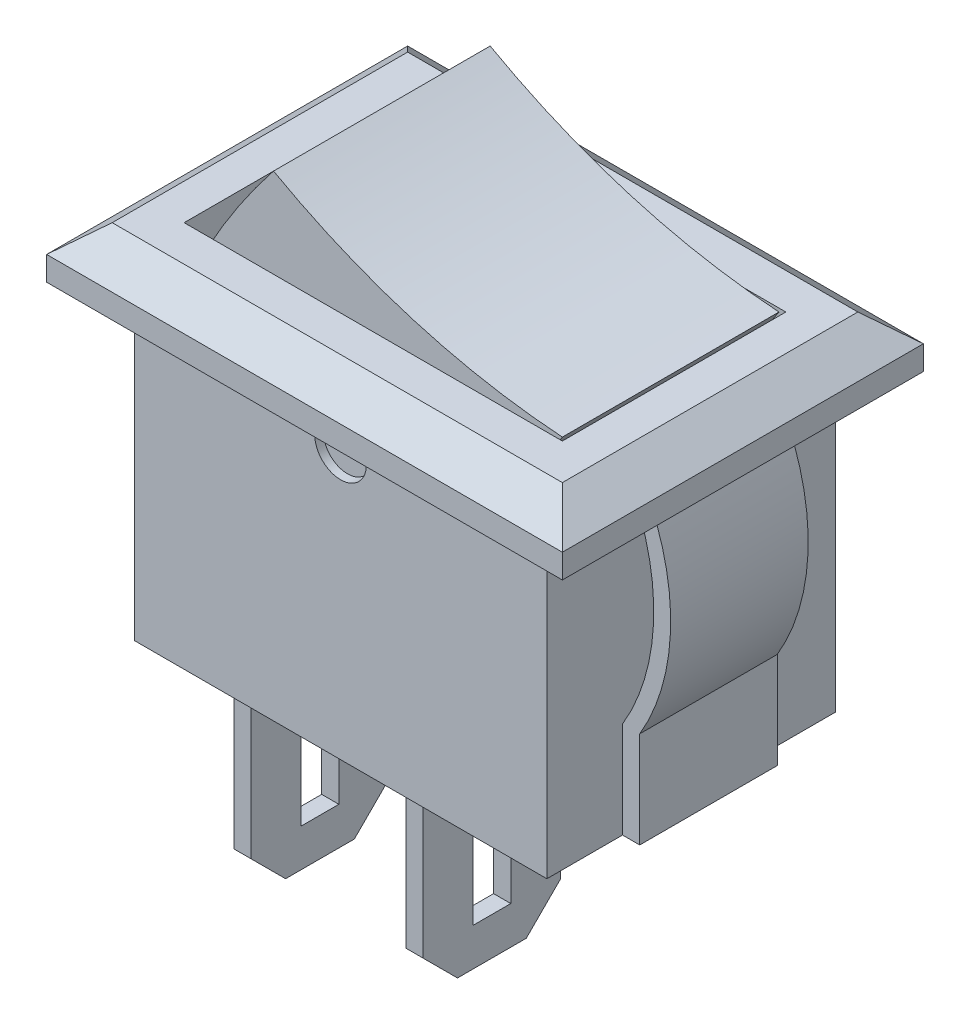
ISO-10303-21;
HEADER;
FILE_DESCRIPTION(('STEP AP214'),'2;1');
FILE_NAME('part.step','',(''),(''),'','','');
FILE_SCHEMA(('AUTOMOTIVE_DESIGN { 1 0 10303 214 1 1 1 1 }'));
ENDSEC;
DATA;
#1=APPLICATION_CONTEXT('core data for automotive mechanical design processes');
#2=APPLICATION_PROTOCOL_DEFINITION('international standard','automotive_design',2000,#1);
#3=PRODUCT_CONTEXT('',#1,'mechanical');
#4=PRODUCT('Part','Part','',(#3));
#5=PRODUCT_RELATED_PRODUCT_CATEGORY('part','',(#4));
#6=PRODUCT_DEFINITION_FORMATION('','',#4);
#7=PRODUCT_DEFINITION_CONTEXT('part definition',#1,'design');
#8=PRODUCT_DEFINITION('design','',#6,#7);
#9=PRODUCT_DEFINITION_SHAPE('','',#8);
#10=(LENGTH_UNIT() NAMED_UNIT(*) SI_UNIT(.MILLI.,.METRE.));
#11=(NAMED_UNIT(*) PLANE_ANGLE_UNIT() SI_UNIT($,.RADIAN.));
#12=(NAMED_UNIT(*) SI_UNIT($,.STERADIAN.) SOLID_ANGLE_UNIT());
#13=UNCERTAINTY_MEASURE_WITH_UNIT(LENGTH_MEASURE(1.E-05),#10,'distance_accuracy_value','');
#14=(GEOMETRIC_REPRESENTATION_CONTEXT(3) GLOBAL_UNCERTAINTY_ASSIGNED_CONTEXT((#13)) GLOBAL_UNIT_ASSIGNED_CONTEXT((#10,
#11,#12)) REPRESENTATION_CONTEXT('',''));
#15=CARTESIAN_POINT('',(0.,0.,0.));
#16=DIRECTION('',(0.,0.,1.));
#17=DIRECTION('',(1.,0.,0.));
#18=AXIS2_PLACEMENT_3D('',#15,#16,#17);
#19=CARTESIAN_POINT('',(-0.299999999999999,-7.,2.));
#20=DIRECTION('',(0.,0.,-1.));
#21=DIRECTION('',(-1.,0.,0.));
#22=AXIS2_PLACEMENT_3D('',#19,#20,#21);
#23=PLANE('',#22);
#24=DIRECTION('',(0.,1.,0.));
#25=VECTOR('',#24,1.);
#26=CARTESIAN_POINT('',(-0.299999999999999,-7.,2.));
#27=LINE('',#26,#25);
#28=CARTESIAN_POINT('',(-0.299999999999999,-5.99999999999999,2.));
#29=VERTEX_POINT('',#28);
#30=CARTESIAN_POINT('',(-0.299999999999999,0.,2.));
#31=VERTEX_POINT('',#30);
#32=EDGE_CURVE('E142',#29,#31,#27,.T.);
#33=ORIENTED_EDGE('',*,*,#32,.F.);
#34=DIRECTION('',(-1.,0.,0.));
#35=VECTOR('',#34,1.);
#36=CARTESIAN_POINT('',(7.5,-5.99999999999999,2.));
#37=LINE('',#36,#35);
#38=CARTESIAN_POINT('',(0.200000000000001,-5.99999999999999,2.));
#39=VERTEX_POINT('',#38);
#40=EDGE_CURVE('E126',#39,#29,#37,.T.);
#41=ORIENTED_EDGE('',*,*,#40,.F.);
#42=DIRECTION('',(0.,1.,0.));
#43=VECTOR('',#42,1.);
#44=CARTESIAN_POINT('',(0.200000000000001,-7.,2.));
#45=LINE('',#44,#43);
#46=CARTESIAN_POINT('',(0.200000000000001,0.,2.));
#47=VERTEX_POINT('',#46);
#48=EDGE_CURVE('E140',#39,#47,#45,.T.);
#49=ORIENTED_EDGE('',*,*,#48,.T.);
#50=DIRECTION('',(-1.,0.,0.));
#51=VECTOR('',#50,1.);
#52=CARTESIAN_POINT('',(-0.299999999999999,0.,2.));
#53=LINE('',#52,#51);
#54=EDGE_CURVE('E165',#47,#31,#53,.T.);
#55=ORIENTED_EDGE('',*,*,#54,.T.);
#56=EDGE_LOOP('',(#33,#41,#49,#55));
#57=FACE_BOUND('',#56,.T.);
#58=ADVANCED_FACE('F48',(#57),#23,.F.);
#59=CARTESIAN_POINT('',(-0.299999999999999,-7.,-2.));
#60=DIRECTION('',(1.,0.,0.));
#61=DIRECTION('',(0.,0.,-1.));
#62=AXIS2_PLACEMENT_3D('',#59,#60,#61);
#63=PLANE('',#62);
#64=DIRECTION('',(0.,0.,1.));
#65=VECTOR('',#64,1.);
#66=CARTESIAN_POINT('',(-0.299999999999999,-3.3,-2.));
#67=LINE('',#66,#65);
#68=CARTESIAN_POINT('',(-0.299999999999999,-3.3,-0.55));
#69=VERTEX_POINT('',#68);
#70=CARTESIAN_POINT('',(-0.299999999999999,-3.3,0.55));
#71=VERTEX_POINT('',#70);
#72=EDGE_CURVE('E205',#69,#71,#67,.T.);
#73=ORIENTED_EDGE('',*,*,#72,.T.);
#74=DIRECTION('',(0.,-1.,0.));
#75=VECTOR('',#74,1.);
#76=CARTESIAN_POINT('',(-0.299999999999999,-7.,0.550000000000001));
#77=LINE('',#76,#75);
#78=CARTESIAN_POINT('',(-0.299999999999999,-5.9,0.55));
#79=VERTEX_POINT('',#78);
#80=EDGE_CURVE('E211',#71,#79,#77,.T.);
#81=ORIENTED_EDGE('',*,*,#80,.T.);
#82=DIRECTION('',(0.,0.,-1.));
#83=VECTOR('',#82,1.);
#84=CARTESIAN_POINT('',(-0.299999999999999,-5.9,-2.));
#85=LINE('',#84,#83);
#86=CARTESIAN_POINT('',(-0.299999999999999,-5.9,-0.55));
#87=VERTEX_POINT('',#86);
#88=EDGE_CURVE('E209',#79,#87,#85,.T.);
#89=ORIENTED_EDGE('',*,*,#88,.T.);
#90=DIRECTION('',(0.,1.,0.));
#91=VECTOR('',#90,1.);
#92=CARTESIAN_POINT('',(-0.299999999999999,-7.,-0.55));
#93=LINE('',#92,#91);
#94=EDGE_CURVE('E190',#87,#69,#93,.T.);
#95=ORIENTED_EDGE('',*,*,#94,.T.);
#96=EDGE_LOOP('',(#73,#81,#89,#95));
#97=FACE_BOUND('',#96,.T.);
#98=DIRECTION('',(0.,1.,0.));
#99=VECTOR('',#98,1.);
#100=CARTESIAN_POINT('',(-0.299999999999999,-7.,-2.));
#101=LINE('',#100,#99);
#102=CARTESIAN_POINT('',(-0.299999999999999,-5.99999999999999,-2.));
#103=VERTEX_POINT('',#102);
#104=CARTESIAN_POINT('',(-0.299999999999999,0.,-2.));
#105=VERTEX_POINT('',#104);
#106=EDGE_CURVE('E154',#103,#105,#101,.T.);
#107=ORIENTED_EDGE('',*,*,#106,.F.);
#108=DIRECTION('',(0.,-0.707106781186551,0.707106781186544));
#109=VECTOR('',#108,1.);
#110=CARTESIAN_POINT('',(-0.299999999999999,-6.5,-1.49999999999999));
#111=LINE('',#110,#109);
#112=CARTESIAN_POINT('',(-0.299999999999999,-7.,-0.999999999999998));
#113=VERTEX_POINT('',#112);
#114=EDGE_CURVE('E202',#103,#113,#111,.T.);
#115=ORIENTED_EDGE('',*,*,#114,.T.);
#116=DIRECTION('',(0.,0.,-1.));
#117=VECTOR('',#116,1.);
#118=CARTESIAN_POINT('',(-0.299999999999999,-7.,-2.));
#119=LINE('',#118,#117);
#120=CARTESIAN_POINT('',(-0.299999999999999,-7.,1.));
#121=VERTEX_POINT('',#120);
#122=EDGE_CURVE('E152',#121,#113,#119,.T.);
#123=ORIENTED_EDGE('',*,*,#122,.F.);
#124=DIRECTION('',(0.,0.707106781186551,0.707106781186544));
#125=VECTOR('',#124,1.);
#126=CARTESIAN_POINT('',(-0.299999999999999,-8.5,-0.499999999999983));
#127=LINE('',#126,#125);
#128=EDGE_CURVE('E134',#121,#29,#127,.T.);
#129=ORIENTED_EDGE('',*,*,#128,.T.);
#130=ORIENTED_EDGE('',*,*,#32,.T.);
#131=DIRECTION('',(0.,0.,-1.));
#132=VECTOR('',#131,1.);
#133=CARTESIAN_POINT('',(-0.299999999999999,0.,-2.));
#134=LINE('',#133,#132);
#135=EDGE_CURVE('E162',#31,#105,#134,.T.);
#136=ORIENTED_EDGE('',*,*,#135,.T.);
#137=EDGE_LOOP('',(#107,#115,#123,#129,#130,#136));
#138=FACE_BOUND('',#137,.T.);
#139=ADVANCED_FACE('F221',(#97,#138),#63,.F.);
#140=CARTESIAN_POINT('',(-0.299999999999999,-7.,-2.));
#141=DIRECTION('',(0.,0.,1.));
#142=DIRECTION('',(1.,0.,0.));
#143=AXIS2_PLACEMENT_3D('',#140,#141,#142);
#144=PLANE('',#143);
#145=DIRECTION('',(0.,1.,0.));
#146=VECTOR('',#145,1.);
#147=CARTESIAN_POINT('',(0.200000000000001,-7.,-2.));
#148=LINE('',#147,#146);
#149=CARTESIAN_POINT('',(0.200000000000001,-5.99999999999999,-2.));
#150=VERTEX_POINT('',#149);
#151=CARTESIAN_POINT('',(0.200000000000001,0.,-2.));
#152=VERTEX_POINT('',#151);
#153=EDGE_CURVE('E150',#150,#152,#148,.T.);
#154=ORIENTED_EDGE('',*,*,#153,.F.);
#155=DIRECTION('',(-1.,0.,0.));
#156=VECTOR('',#155,1.);
#157=CARTESIAN_POINT('',(7.5,-5.99999999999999,-2.));
#158=LINE('',#157,#156);
#159=EDGE_CURVE('E143',#150,#103,#158,.T.);
#160=ORIENTED_EDGE('',*,*,#159,.T.);
#161=ORIENTED_EDGE('',*,*,#106,.T.);
#162=DIRECTION('',(1.,0.,0.));
#163=VECTOR('',#162,1.);
#164=CARTESIAN_POINT('',(-0.299999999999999,0.,-2.));
#165=LINE('',#164,#163);
#166=EDGE_CURVE('E159',#105,#152,#165,.T.);
#167=ORIENTED_EDGE('',*,*,#166,.T.);
#168=EDGE_LOOP('',(#154,#160,#161,#167));
#169=FACE_BOUND('',#168,.T.);
#170=ADVANCED_FACE('F217',(#169),#144,.F.);
#171=CARTESIAN_POINT('',(0.200000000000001,-7.,-2.));
#172=DIRECTION('',(-1.,0.,0.));
#173=DIRECTION('',(0.,0.,1.));
#174=AXIS2_PLACEMENT_3D('',#171,#172,#173);
#175=PLANE('',#174);
#176=DIRECTION('',(0.,0.,1.));
#177=VECTOR('',#176,1.);
#178=CARTESIAN_POINT('',(0.200000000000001,-5.9,-2.));
#179=LINE('',#178,#177);
#180=CARTESIAN_POINT('',(0.200000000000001,-5.9,-0.55));
#181=VERTEX_POINT('',#180);
#182=CARTESIAN_POINT('',(0.200000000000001,-5.9,0.55));
#183=VERTEX_POINT('',#182);
#184=EDGE_CURVE('E56',#181,#183,#179,.T.);
#185=ORIENTED_EDGE('',*,*,#184,.T.);
#186=DIRECTION('',(0.,1.,0.));
#187=VECTOR('',#186,1.);
#188=CARTESIAN_POINT('',(0.200000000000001,-7.,0.550000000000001));
#189=LINE('',#188,#187);
#190=CARTESIAN_POINT('',(0.200000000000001,-3.3,0.55));
#191=VERTEX_POINT('',#190);
#192=EDGE_CURVE('E12',#183,#191,#189,.T.);
#193=ORIENTED_EDGE('',*,*,#192,.T.);
#194=DIRECTION('',(0.,0.,-1.));
#195=VECTOR('',#194,1.);
#196=CARTESIAN_POINT('',(0.200000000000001,-3.3,-2.));
#197=LINE('',#196,#195);
#198=CARTESIAN_POINT('',(0.200000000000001,-3.3,-0.55));
#199=VERTEX_POINT('',#198);
#200=EDGE_CURVE('E172',#191,#199,#197,.T.);
#201=ORIENTED_EDGE('',*,*,#200,.T.);
#202=DIRECTION('',(0.,-1.,0.));
#203=VECTOR('',#202,1.);
#204=CARTESIAN_POINT('',(0.200000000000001,-7.,-0.55));
#205=LINE('',#204,#203);
#206=EDGE_CURVE('E175',#199,#181,#205,.T.);
#207=ORIENTED_EDGE('',*,*,#206,.T.);
#208=EDGE_LOOP('',(#185,#193,#201,#207));
#209=FACE_BOUND('',#208,.T.);
#210=DIRECTION('',(0.,0.,1.));
#211=VECTOR('',#210,1.);
#212=CARTESIAN_POINT('',(0.200000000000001,-7.,-2.));
#213=LINE('',#212,#211);
#214=CARTESIAN_POINT('',(0.200000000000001,-7.,-0.999999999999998));
#215=VERTEX_POINT('',#214);
#216=CARTESIAN_POINT('',(0.200000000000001,-7.,1.));
#217=VERTEX_POINT('',#216);
#218=EDGE_CURVE('E149',#215,#217,#213,.T.);
#219=ORIENTED_EDGE('',*,*,#218,.F.);
#220=DIRECTION('',(0.,0.707106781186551,-0.707106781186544));
#221=VECTOR('',#220,1.);
#222=CARTESIAN_POINT('',(0.200000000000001,-6.5,-1.49999999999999));
#223=LINE('',#222,#221);
#224=EDGE_CURVE('E199',#215,#150,#223,.T.);
#225=ORIENTED_EDGE('',*,*,#224,.T.);
#226=ORIENTED_EDGE('',*,*,#153,.T.);
#227=DIRECTION('',(0.,0.,1.));
#228=VECTOR('',#227,1.);
#229=CARTESIAN_POINT('',(0.200000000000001,0.,-2.));
#230=LINE('',#229,#228);
#231=EDGE_CURVE('E147',#152,#47,#230,.T.);
#232=ORIENTED_EDGE('',*,*,#231,.T.);
#233=ORIENTED_EDGE('',*,*,#48,.F.);
#234=DIRECTION('',(0.,-0.707106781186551,-0.707106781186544));
#235=VECTOR('',#234,1.);
#236=CARTESIAN_POINT('',(0.200000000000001,-8.5,-0.499999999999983));
#237=LINE('',#236,#235);
#238=EDGE_CURVE('E123',#39,#217,#237,.T.);
#239=ORIENTED_EDGE('',*,*,#238,.T.);
#240=EDGE_LOOP('',(#219,#225,#226,#232,#233,#239));
#241=FACE_BOUND('',#240,.T.);
#242=ADVANCED_FACE('F145',(#209,#241),#175,.F.);
#243=CARTESIAN_POINT('',(0.,-7.,0.));
#244=DIRECTION('',(0.,-1.,0.));
#245=DIRECTION('',(0.,0.,-1.));
#246=AXIS2_PLACEMENT_3D('',#243,#244,#245);
#247=PLANE('',#246);
#248=DIRECTION('',(-1.,0.,0.));
#249=VECTOR('',#248,1.);
#250=CARTESIAN_POINT('',(0.,-7.,-0.999999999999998));
#251=LINE('',#250,#249);
#252=EDGE_CURVE('E170',#215,#113,#251,.T.);
#253=ORIENTED_EDGE('',*,*,#252,.F.);
#254=ORIENTED_EDGE('',*,*,#218,.T.);
#255=DIRECTION('',(1.,0.,0.));
#256=VECTOR('',#255,1.);
#257=CARTESIAN_POINT('',(0.,-7.,1.));
#258=LINE('',#257,#256);
#259=EDGE_CURVE('E129',#121,#217,#258,.T.);
#260=ORIENTED_EDGE('',*,*,#259,.F.);
#261=ORIENTED_EDGE('',*,*,#122,.T.);
#262=EDGE_LOOP('',(#253,#254,#260,#261));
#263=FACE_BOUND('',#262,.T.);
#264=ADVANCED_FACE('F50',(#263),#247,.T.);
#265=CARTESIAN_POINT('',(0.,0.,0.));
#266=DIRECTION('',(0.,-1.,0.));
#267=DIRECTION('',(0.,0.,-1.));
#268=AXIS2_PLACEMENT_3D('',#265,#266,#267);
#269=PLANE('',#268);
#270=ORIENTED_EDGE('',*,*,#54,.F.);
#271=ORIENTED_EDGE('',*,*,#231,.F.);
#272=ORIENTED_EDGE('',*,*,#166,.F.);
#273=ORIENTED_EDGE('',*,*,#135,.F.);
#274=EDGE_LOOP('',(#270,#271,#272,#273));
#275=FACE_BOUND('',#274,.T.);
#276=ADVANCED_FACE('F223',(#275),#269,.F.);
#277=CARTESIAN_POINT('',(7.5,-5.99999999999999,2.));
#278=DIRECTION('',(0.,0.707106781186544,-0.707106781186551));
#279=DIRECTION('',(0.,0.707106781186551,0.707106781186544));
#280=AXIS2_PLACEMENT_3D('',#277,#278,#279);
#281=PLANE('',#280);
#282=ORIENTED_EDGE('',*,*,#259,.T.);
#283=ORIENTED_EDGE('',*,*,#238,.F.);
#284=ORIENTED_EDGE('',*,*,#40,.T.);
#285=ORIENTED_EDGE('',*,*,#128,.F.);
#286=EDGE_LOOP('',(#282,#283,#284,#285));
#287=FACE_BOUND('',#286,.T.);
#288=ADVANCED_FACE('F125',(#287),#281,.F.);
#289=CARTESIAN_POINT('',(7.5,-5.99999999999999,-2.));
#290=DIRECTION('',(0.,0.707106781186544,0.707106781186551));
#291=DIRECTION('',(0.,-0.707106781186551,0.707106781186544));
#292=AXIS2_PLACEMENT_3D('',#289,#290,#291);
#293=PLANE('',#292);
#294=ORIENTED_EDGE('',*,*,#159,.F.);
#295=ORIENTED_EDGE('',*,*,#224,.F.);
#296=ORIENTED_EDGE('',*,*,#252,.T.);
#297=ORIENTED_EDGE('',*,*,#114,.F.);
#298=EDGE_LOOP('',(#294,#295,#296,#297));
#299=FACE_BOUND('',#298,.T.);
#300=ADVANCED_FACE('F229',(#299),#293,.F.);
#301=CARTESIAN_POINT('',(7.5,-3.3,0.55));
#302=DIRECTION('',(0.,0.,1.));
#303=DIRECTION('',(0.,-1.,0.));
#304=AXIS2_PLACEMENT_3D('',#301,#302,#303);
#305=PLANE('',#304);
#306=DIRECTION('',(-1.,0.,0.));
#307=VECTOR('',#306,1.);
#308=CARTESIAN_POINT('',(7.5,-3.3,0.55));
#309=LINE('',#308,#307);
#310=EDGE_CURVE('E63',#191,#71,#309,.T.);
#311=ORIENTED_EDGE('',*,*,#310,.F.);
#312=ORIENTED_EDGE('',*,*,#192,.F.);
#313=DIRECTION('',(-1.,0.,0.));
#314=VECTOR('',#313,1.);
#315=CARTESIAN_POINT('',(7.5,-5.9,0.55));
#316=LINE('',#315,#314);
#317=EDGE_CURVE('E135',#183,#79,#316,.T.);
#318=ORIENTED_EDGE('',*,*,#317,.T.);
#319=ORIENTED_EDGE('',*,*,#80,.F.);
#320=EDGE_LOOP('',(#311,#312,#318,#319));
#321=FACE_BOUND('',#320,.T.);
#322=ADVANCED_FACE('F270',(#321),#305,.F.);
#323=CARTESIAN_POINT('',(7.5,-5.9,-0.55));
#324=DIRECTION('',(0.,-1.,0.));
#325=DIRECTION('',(0.,0.,-1.));
#326=AXIS2_PLACEMENT_3D('',#323,#324,#325);
#327=PLANE('',#326);
#328=ORIENTED_EDGE('',*,*,#317,.F.);
#329=ORIENTED_EDGE('',*,*,#184,.F.);
#330=DIRECTION('',(-1.,0.,0.));
#331=VECTOR('',#330,1.);
#332=CARTESIAN_POINT('',(7.5,-5.9,-0.55));
#333=LINE('',#332,#331);
#334=EDGE_CURVE('E184',#181,#87,#333,.T.);
#335=ORIENTED_EDGE('',*,*,#334,.T.);
#336=ORIENTED_EDGE('',*,*,#88,.F.);
#337=EDGE_LOOP('',(#328,#329,#335,#336));
#338=FACE_BOUND('',#337,.T.);
#339=ADVANCED_FACE('F183',(#338),#327,.F.);
#340=CARTESIAN_POINT('',(7.5,-3.3,-0.55));
#341=DIRECTION('',(0.,0.,-1.));
#342=DIRECTION('',(0.,1.,0.));
#343=AXIS2_PLACEMENT_3D('',#340,#341,#342);
#344=PLANE('',#343);
#345=ORIENTED_EDGE('',*,*,#334,.F.);
#346=ORIENTED_EDGE('',*,*,#206,.F.);
#347=DIRECTION('',(-1.,0.,0.));
#348=VECTOR('',#347,1.);
#349=CARTESIAN_POINT('',(7.5,-3.3,-0.55));
#350=LINE('',#349,#348);
#351=EDGE_CURVE('E68',#199,#69,#350,.T.);
#352=ORIENTED_EDGE('',*,*,#351,.T.);
#353=ORIENTED_EDGE('',*,*,#94,.F.);
#354=EDGE_LOOP('',(#345,#346,#352,#353));
#355=FACE_BOUND('',#354,.T.);
#356=ADVANCED_FACE('F188',(#355),#344,.F.);
#357=CARTESIAN_POINT('',(7.5,-3.3,-0.55));
#358=DIRECTION('',(0.,1.,0.));
#359=DIRECTION('',(0.,0.,1.));
#360=AXIS2_PLACEMENT_3D('',#357,#358,#359);
#361=PLANE('',#360);
#362=ORIENTED_EDGE('',*,*,#351,.F.);
#363=ORIENTED_EDGE('',*,*,#200,.F.);
#364=ORIENTED_EDGE('',*,*,#310,.T.);
#365=ORIENTED_EDGE('',*,*,#72,.F.);
#366=EDGE_LOOP('',(#362,#363,#364,#365));
#367=FACE_BOUND('',#366,.T.);
#368=ADVANCED_FACE('F299',(#367),#361,.F.);
#369=CLOSED_SHELL('',(#58,#139,#170,#242,#264,#276,#288,#300,#322,#339,#356,#368));
#370=MANIFOLD_SOLID_BREP('B2',#369);
#371=CARTESIAN_POINT('',(-4.8,-7.,-2.));
#372=DIRECTION('',(-1.,0.,0.));
#373=DIRECTION('',(0.,0.,1.));
#374=AXIS2_PLACEMENT_3D('',#371,#372,#373);
#375=PLANE('',#374);
#376=DIRECTION('',(0.,0.,1.));
#377=VECTOR('',#376,1.);
#378=CARTESIAN_POINT('',(-4.8,-5.9,-2.));
#379=LINE('',#378,#377);
#380=CARTESIAN_POINT('',(-4.8,-5.9,-0.55));
#381=VERTEX_POINT('',#380);
#382=CARTESIAN_POINT('',(-4.8,-5.9,0.55));
#383=VERTEX_POINT('',#382);
#384=EDGE_CURVE('E486',#381,#383,#379,.T.);
#385=ORIENTED_EDGE('',*,*,#384,.T.);
#386=DIRECTION('',(0.,1.,0.));
#387=VECTOR('',#386,1.);
#388=CARTESIAN_POINT('',(-4.8,-7.,0.550000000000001));
#389=LINE('',#388,#387);
#390=CARTESIAN_POINT('',(-4.8,-3.3,0.55));
#391=VERTEX_POINT('',#390);
#392=EDGE_CURVE('E489',#383,#391,#389,.T.);
#393=ORIENTED_EDGE('',*,*,#392,.T.);
#394=DIRECTION('',(0.,0.,-1.));
#395=VECTOR('',#394,1.);
#396=CARTESIAN_POINT('',(-4.8,-3.3,-2.));
#397=LINE('',#396,#395);
#398=CARTESIAN_POINT('',(-4.8,-3.3,-0.55));
#399=VERTEX_POINT('',#398);
#400=EDGE_CURVE('E483',#391,#399,#397,.T.);
#401=ORIENTED_EDGE('',*,*,#400,.T.);
#402=DIRECTION('',(0.,-1.,0.));
#403=VECTOR('',#402,1.);
#404=CARTESIAN_POINT('',(-4.8,-7.,-0.55));
#405=LINE('',#404,#403);
#406=EDGE_CURVE('E446',#399,#381,#405,.T.);
#407=ORIENTED_EDGE('',*,*,#406,.T.);
#408=EDGE_LOOP('',(#385,#393,#401,#407));
#409=FACE_BOUND('',#408,.T.);
#410=DIRECTION('',(0.,0.,1.));
#411=VECTOR('',#410,1.);
#412=CARTESIAN_POINT('',(-4.8,-7.,-2.));
#413=LINE('',#412,#411);
#414=CARTESIAN_POINT('',(-4.8,-7.,-0.999999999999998));
#415=VERTEX_POINT('',#414);
#416=CARTESIAN_POINT('',(-4.8,-7.,1.));
#417=VERTEX_POINT('',#416);
#418=EDGE_CURVE('E493',#415,#417,#413,.T.);
#419=ORIENTED_EDGE('',*,*,#418,.F.);
#420=DIRECTION('',(0.,0.707106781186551,-0.707106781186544));
#421=VECTOR('',#420,1.);
#422=CARTESIAN_POINT('',(-4.8,-6.5,-1.49999999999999));
#423=LINE('',#422,#421);
#424=CARTESIAN_POINT('',(-4.8,-5.99999999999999,-2.));
#425=VERTEX_POINT('',#424);
#426=EDGE_CURVE('E480',#415,#425,#423,.T.);
#427=ORIENTED_EDGE('',*,*,#426,.T.);
#428=DIRECTION('',(0.,1.,0.));
#429=VECTOR('',#428,1.);
#430=CARTESIAN_POINT('',(-4.8,-7.,-2.));
#431=LINE('',#430,#429);
#432=CARTESIAN_POINT('',(-4.8,0.,-2.));
#433=VERTEX_POINT('',#432);
#434=EDGE_CURVE('E500',#425,#433,#431,.T.);
#435=ORIENTED_EDGE('',*,*,#434,.T.);
#436=DIRECTION('',(0.,0.,1.));
#437=VECTOR('',#436,1.);
#438=CARTESIAN_POINT('',(-4.8,0.,-2.));
#439=LINE('',#438,#437);
#440=CARTESIAN_POINT('',(-4.8,0.,2.));
#441=VERTEX_POINT('',#440);
#442=EDGE_CURVE('E492',#433,#441,#439,.T.);
#443=ORIENTED_EDGE('',*,*,#442,.T.);
#444=DIRECTION('',(0.,1.,0.));
#445=VECTOR('',#444,1.);
#446=CARTESIAN_POINT('',(-4.8,-7.,2.));
#447=LINE('',#446,#445);
#448=CARTESIAN_POINT('',(-4.8,-5.99999999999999,2.));
#449=VERTEX_POINT('',#448);
#450=EDGE_CURVE('E516',#449,#441,#447,.T.);
#451=ORIENTED_EDGE('',*,*,#450,.F.);
#452=DIRECTION('',(0.,-0.707106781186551,-0.707106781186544));
#453=VECTOR('',#452,1.);
#454=CARTESIAN_POINT('',(-4.8,-8.5,-0.499999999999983));
#455=LINE('',#454,#453);
#456=EDGE_CURVE('E466',#449,#417,#455,.T.);
#457=ORIENTED_EDGE('',*,*,#456,.T.);
#458=EDGE_LOOP('',(#419,#427,#435,#443,#451,#457));
#459=FACE_BOUND('',#458,.T.);
#460=ADVANCED_FACE('F364',(#409,#459),#375,.F.);
#461=CARTESIAN_POINT('',(-5.3,-7.,2.));
#462=DIRECTION('',(0.,0.,-1.));
#463=DIRECTION('',(-1.,0.,0.));
#464=AXIS2_PLACEMENT_3D('',#461,#462,#463);
#465=PLANE('',#464);
#466=DIRECTION('',(0.,1.,0.));
#467=VECTOR('',#466,1.);
#468=CARTESIAN_POINT('',(-5.3,-7.,2.));
#469=LINE('',#468,#467);
#470=CARTESIAN_POINT('',(-5.3,-5.99999999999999,2.));
#471=VERTEX_POINT('',#470);
#472=CARTESIAN_POINT('',(-5.3,0.,2.));
#473=VERTEX_POINT('',#472);
#474=EDGE_CURVE('E514',#471,#473,#469,.T.);
#475=ORIENTED_EDGE('',*,*,#474,.F.);
#476=DIRECTION('',(-1.,0.,0.));
#477=VECTOR('',#476,1.);
#478=CARTESIAN_POINT('',(7.5,-5.99999999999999,2.));
#479=LINE('',#478,#477);
#480=EDGE_CURVE('E475',#449,#471,#479,.T.);
#481=ORIENTED_EDGE('',*,*,#480,.F.);
#482=ORIENTED_EDGE('',*,*,#450,.T.);
#483=DIRECTION('',(-1.,0.,0.));
#484=VECTOR('',#483,1.);
#485=CARTESIAN_POINT('',(-5.3,0.,2.));
#486=LINE('',#485,#484);
#487=EDGE_CURVE('E503',#441,#473,#486,.T.);
#488=ORIENTED_EDGE('',*,*,#487,.T.);
#489=EDGE_LOOP('',(#475,#481,#482,#488));
#490=FACE_BOUND('',#489,.T.);
#491=ADVANCED_FACE('F539',(#490),#465,.F.);
#492=CARTESIAN_POINT('',(-5.3,-7.,-2.));
#493=DIRECTION('',(1.,0.,0.));
#494=DIRECTION('',(0.,0.,-1.));
#495=AXIS2_PLACEMENT_3D('',#492,#493,#494);
#496=PLANE('',#495);
#497=DIRECTION('',(0.,0.,-1.));
#498=VECTOR('',#497,1.);
#499=CARTESIAN_POINT('',(-5.3,-3.3,-0.55));
#500=LINE('',#499,#498);
#501=CARTESIAN_POINT('',(-5.3,-3.3,0.55));
#502=VERTEX_POINT('',#501);
#503=CARTESIAN_POINT('',(-5.3,-3.3,-0.55));
#504=VERTEX_POINT('',#503);
#505=EDGE_CURVE('E452',#502,#504,#500,.T.);
#506=ORIENTED_EDGE('',*,*,#505,.F.);
#507=DIRECTION('',(0.,1.,0.));
#508=VECTOR('',#507,1.);
#509=CARTESIAN_POINT('',(-5.3,-3.3,0.55));
#510=LINE('',#509,#508);
#511=CARTESIAN_POINT('',(-5.3,-5.9,0.55));
#512=VERTEX_POINT('',#511);
#513=EDGE_CURVE('E386',#512,#502,#510,.T.);
#514=ORIENTED_EDGE('',*,*,#513,.F.);
#515=DIRECTION('',(0.,0.,1.));
#516=VECTOR('',#515,1.);
#517=CARTESIAN_POINT('',(-5.3,-5.9,-0.55));
#518=LINE('',#517,#516);
#519=CARTESIAN_POINT('',(-5.3,-5.9,-0.55));
#520=VERTEX_POINT('',#519);
#521=EDGE_CURVE('E459',#520,#512,#518,.T.);
#522=ORIENTED_EDGE('',*,*,#521,.F.);
#523=DIRECTION('',(0.,-1.,0.));
#524=VECTOR('',#523,1.);
#525=CARTESIAN_POINT('',(-5.3,-3.3,-0.55));
#526=LINE('',#525,#524);
#527=EDGE_CURVE('E443',#504,#520,#526,.T.);
#528=ORIENTED_EDGE('',*,*,#527,.F.);
#529=EDGE_LOOP('',(#506,#514,#522,#528));
#530=FACE_BOUND('',#529,.T.);
#531=DIRECTION('',(0.,1.,0.));
#532=VECTOR('',#531,1.);
#533=CARTESIAN_POINT('',(-5.3,-7.,-2.));
#534=LINE('',#533,#532);
#535=CARTESIAN_POINT('',(-5.3,-5.99999999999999,-2.));
#536=VERTEX_POINT('',#535);
#537=CARTESIAN_POINT('',(-5.3,0.,-2.));
#538=VERTEX_POINT('',#537);
#539=EDGE_CURVE('E512',#536,#538,#534,.T.);
#540=ORIENTED_EDGE('',*,*,#539,.F.);
#541=DIRECTION('',(0.,0.707106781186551,-0.707106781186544));
#542=VECTOR('',#541,1.);
#543=CARTESIAN_POINT('',(-5.3,-5.99999999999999,-2.));
#544=LINE('',#543,#542);
#545=CARTESIAN_POINT('',(-5.3,-7.,-0.999999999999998));
#546=VERTEX_POINT('',#545);
#547=EDGE_CURVE('E472',#546,#536,#544,.T.);
#548=ORIENTED_EDGE('',*,*,#547,.F.);
#549=DIRECTION('',(0.,0.,-1.));
#550=VECTOR('',#549,1.);
#551=CARTESIAN_POINT('',(-5.3,-7.,-2.));
#552=LINE('',#551,#550);
#553=CARTESIAN_POINT('',(-5.3,-7.,1.));
#554=VERTEX_POINT('',#553);
#555=EDGE_CURVE('E496',#554,#546,#552,.T.);
#556=ORIENTED_EDGE('',*,*,#555,.F.);
#557=DIRECTION('',(0.,-0.707106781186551,-0.707106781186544));
#558=VECTOR('',#557,1.);
#559=CARTESIAN_POINT('',(-5.3,-5.99999999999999,2.));
#560=LINE('',#559,#558);
#561=EDGE_CURVE('E473',#471,#554,#560,.T.);
#562=ORIENTED_EDGE('',*,*,#561,.F.);
#563=ORIENTED_EDGE('',*,*,#474,.T.);
#564=DIRECTION('',(0.,0.,-1.));
#565=VECTOR('',#564,1.);
#566=CARTESIAN_POINT('',(-5.3,0.,-2.));
#567=LINE('',#566,#565);
#568=EDGE_CURVE('E506',#473,#538,#567,.T.);
#569=ORIENTED_EDGE('',*,*,#568,.T.);
#570=EDGE_LOOP('',(#540,#548,#556,#562,#563,#569));
#571=FACE_BOUND('',#570,.T.);
#572=ADVANCED_FACE('F456',(#530,#571),#496,.F.);
#573=CARTESIAN_POINT('',(-5.3,-7.,-2.));
#574=DIRECTION('',(0.,0.,1.));
#575=DIRECTION('',(1.,0.,0.));
#576=AXIS2_PLACEMENT_3D('',#573,#574,#575);
#577=PLANE('',#576);
#578=ORIENTED_EDGE('',*,*,#434,.F.);
#579=DIRECTION('',(-1.,0.,0.));
#580=VECTOR('',#579,1.);
#581=CARTESIAN_POINT('',(7.5,-5.99999999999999,-2.));
#582=LINE('',#581,#580);
#583=EDGE_CURVE('E469',#425,#536,#582,.T.);
#584=ORIENTED_EDGE('',*,*,#583,.T.);
#585=ORIENTED_EDGE('',*,*,#539,.T.);
#586=DIRECTION('',(1.,0.,0.));
#587=VECTOR('',#586,1.);
#588=CARTESIAN_POINT('',(-5.3,0.,-2.));
#589=LINE('',#588,#587);
#590=EDGE_CURVE('E497',#538,#433,#589,.T.);
#591=ORIENTED_EDGE('',*,*,#590,.T.);
#592=EDGE_LOOP('',(#578,#584,#585,#591));
#593=FACE_BOUND('',#592,.T.);
#594=ADVANCED_FACE('F531',(#593),#577,.F.);
#595=CARTESIAN_POINT('',(0.,-7.,0.));
#596=DIRECTION('',(0.,1.,0.));
#597=DIRECTION('',(0.,0.,1.));
#598=AXIS2_PLACEMENT_3D('',#595,#596,#597);
#599=PLANE('',#598);
#600=ORIENTED_EDGE('',*,*,#555,.T.);
#601=DIRECTION('',(1.,0.,0.));
#602=VECTOR('',#601,1.);
#603=CARTESIAN_POINT('',(0.,-7.,-0.999999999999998));
#604=LINE('',#603,#602);
#605=EDGE_CURVE('E46',#546,#415,#604,.T.);
#606=ORIENTED_EDGE('',*,*,#605,.T.);
#607=ORIENTED_EDGE('',*,*,#418,.T.);
#608=DIRECTION('',(-1.,0.,0.));
#609=VECTOR('',#608,1.);
#610=CARTESIAN_POINT('',(0.,-7.,1.));
#611=LINE('',#610,#609);
#612=EDGE_CURVE('E371',#417,#554,#611,.T.);
#613=ORIENTED_EDGE('',*,*,#612,.T.);
#614=EDGE_LOOP('',(#600,#606,#607,#613));
#615=FACE_BOUND('',#614,.T.);
#616=ADVANCED_FACE('F520',(#615),#599,.F.);
#617=CARTESIAN_POINT('',(0.,0.,0.));
#618=DIRECTION('',(0.,1.,0.));
#619=DIRECTION('',(0.,0.,1.));
#620=AXIS2_PLACEMENT_3D('',#617,#618,#619);
#621=PLANE('',#620);
#622=ORIENTED_EDGE('',*,*,#442,.F.);
#623=ORIENTED_EDGE('',*,*,#590,.F.);
#624=ORIENTED_EDGE('',*,*,#568,.F.);
#625=ORIENTED_EDGE('',*,*,#487,.F.);
#626=EDGE_LOOP('',(#622,#623,#624,#625));
#627=FACE_BOUND('',#626,.T.);
#628=ADVANCED_FACE('F543',(#627),#621,.T.);
#629=CARTESIAN_POINT('',(7.5,-5.99999999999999,2.));
#630=DIRECTION('',(0.,0.707106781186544,-0.707106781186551));
#631=DIRECTION('',(0.,0.707106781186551,0.707106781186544));
#632=AXIS2_PLACEMENT_3D('',#629,#630,#631);
#633=PLANE('',#632);
#634=ORIENTED_EDGE('',*,*,#480,.T.);
#635=ORIENTED_EDGE('',*,*,#561,.T.);
#636=ORIENTED_EDGE('',*,*,#612,.F.);
#637=ORIENTED_EDGE('',*,*,#456,.F.);
#638=EDGE_LOOP('',(#634,#635,#636,#637));
#639=FACE_BOUND('',#638,.T.);
#640=ADVANCED_FACE('F537',(#639),#633,.F.);
#641=CARTESIAN_POINT('',(7.5,-5.99999999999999,-2.));
#642=DIRECTION('',(0.,0.707106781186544,0.707106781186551));
#643=DIRECTION('',(0.,-0.707106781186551,0.707106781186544));
#644=AXIS2_PLACEMENT_3D('',#641,#642,#643);
#645=PLANE('',#644);
#646=ORIENTED_EDGE('',*,*,#605,.F.);
#647=ORIENTED_EDGE('',*,*,#547,.T.);
#648=ORIENTED_EDGE('',*,*,#583,.F.);
#649=ORIENTED_EDGE('',*,*,#426,.F.);
#650=EDGE_LOOP('',(#646,#647,#648,#649));
#651=FACE_BOUND('',#650,.T.);
#652=ADVANCED_FACE('F528',(#651),#645,.F.);
#653=CARTESIAN_POINT('',(7.5,-3.3,0.55));
#654=DIRECTION('',(0.,0.,1.));
#655=DIRECTION('',(0.,-1.,0.));
#656=AXIS2_PLACEMENT_3D('',#653,#654,#655);
#657=PLANE('',#656);
#658=DIRECTION('',(-1.,0.,0.));
#659=VECTOR('',#658,1.);
#660=CARTESIAN_POINT('',(7.5,-5.9,0.55));
#661=LINE('',#660,#659);
#662=EDGE_CURVE('E464',#383,#512,#661,.T.);
#663=ORIENTED_EDGE('',*,*,#662,.T.);
#664=ORIENTED_EDGE('',*,*,#513,.T.);
#665=DIRECTION('',(-1.,0.,0.));
#666=VECTOR('',#665,1.);
#667=CARTESIAN_POINT('',(7.5,-3.3,0.55));
#668=LINE('',#667,#666);
#669=EDGE_CURVE('E449',#391,#502,#668,.T.);
#670=ORIENTED_EDGE('',*,*,#669,.F.);
#671=ORIENTED_EDGE('',*,*,#392,.F.);
#672=EDGE_LOOP('',(#663,#664,#670,#671));
#673=FACE_BOUND('',#672,.T.);
#674=ADVANCED_FACE('F561',(#673),#657,.F.);
#675=CARTESIAN_POINT('',(7.5,-5.9,-0.55));
#676=DIRECTION('',(0.,-1.,0.));
#677=DIRECTION('',(0.,0.,-1.));
#678=AXIS2_PLACEMENT_3D('',#675,#676,#677);
#679=PLANE('',#678);
#680=DIRECTION('',(-1.,0.,0.));
#681=VECTOR('',#680,1.);
#682=CARTESIAN_POINT('',(7.5,-5.9,-0.55));
#683=LINE('',#682,#681);
#684=EDGE_CURVE('E448',#381,#520,#683,.T.);
#685=ORIENTED_EDGE('',*,*,#684,.T.);
#686=ORIENTED_EDGE('',*,*,#521,.T.);
#687=ORIENTED_EDGE('',*,*,#662,.F.);
#688=ORIENTED_EDGE('',*,*,#384,.F.);
#689=EDGE_LOOP('',(#685,#686,#687,#688));
#690=FACE_BOUND('',#689,.T.);
#691=ADVANCED_FACE('F560',(#690),#679,.F.);
#692=CARTESIAN_POINT('',(7.5,-3.3,-0.55));
#693=DIRECTION('',(0.,0.,-1.));
#694=DIRECTION('',(0.,1.,0.));
#695=AXIS2_PLACEMENT_3D('',#692,#693,#694);
#696=PLANE('',#695);
#697=DIRECTION('',(-1.,0.,0.));
#698=VECTOR('',#697,1.);
#699=CARTESIAN_POINT('',(7.5,-3.3,-0.55));
#700=LINE('',#699,#698);
#701=EDGE_CURVE('E378',#399,#504,#700,.T.);
#702=ORIENTED_EDGE('',*,*,#701,.T.);
#703=ORIENTED_EDGE('',*,*,#527,.T.);
#704=ORIENTED_EDGE('',*,*,#684,.F.);
#705=ORIENTED_EDGE('',*,*,#406,.F.);
#706=EDGE_LOOP('',(#702,#703,#704,#705));
#707=FACE_BOUND('',#706,.T.);
#708=ADVANCED_FACE('F440',(#707),#696,.F.);
#709=CARTESIAN_POINT('',(7.5,-3.3,-0.55));
#710=DIRECTION('',(0.,1.,0.));
#711=DIRECTION('',(0.,0.,1.));
#712=AXIS2_PLACEMENT_3D('',#709,#710,#711);
#713=PLANE('',#712);
#714=ORIENTED_EDGE('',*,*,#669,.T.);
#715=ORIENTED_EDGE('',*,*,#505,.T.);
#716=ORIENTED_EDGE('',*,*,#701,.F.);
#717=ORIENTED_EDGE('',*,*,#400,.F.);
#718=EDGE_LOOP('',(#714,#715,#716,#717));
#719=FACE_BOUND('',#718,.T.);
#720=ADVANCED_FACE('F453',(#719),#713,.F.);
#721=CLOSED_SHELL('',(#460,#491,#572,#594,#616,#628,#640,#652,#674,#691,#708,#720));
#722=MANIFOLD_SOLID_BREP('B6',#721);
#723=CARTESIAN_POINT('',(-0.375700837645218,13.7826756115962,3.15));
#724=DIRECTION('',(0.,0.,-1.));
#725=DIRECTION('',(-1.,0.,0.));
#726=AXIS2_PLACEMENT_3D('',#723,#724,#725);
#727=CYLINDRICAL_SURFACE('',#726,6.74446065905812);
#728=CARTESIAN_POINT('',(-0.375700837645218,13.7826756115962,-3.15));
#729=DIRECTION('',(0.,0.,1.));
#730=DIRECTION('',(1.,0.,0.));
#731=AXIS2_PLACEMENT_3D('',#728,#729,#730);
#732=CIRCLE('',#731,6.74446065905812);
#733=CARTESIAN_POINT('',(-5.3,9.1740936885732,-3.15));
#734=VERTEX_POINT('',#733);
#735=CARTESIAN_POINT('',(5.4,10.3,-3.15));
#736=VERTEX_POINT('',#735);
#737=EDGE_CURVE('E728',#734,#736,#732,.T.);
#738=ORIENTED_EDGE('',*,*,#737,.T.);
#739=DIRECTION('',(0.,0.,-1.));
#740=VECTOR('',#739,1.);
#741=CARTESIAN_POINT('',(5.4,10.3,3.15));
#742=LINE('',#741,#740);
#743=CARTESIAN_POINT('',(5.4,10.3,3.15));
#744=VERTEX_POINT('',#743);
#745=EDGE_CURVE('E687',#744,#736,#742,.T.);
#746=ORIENTED_EDGE('',*,*,#745,.F.);
#747=CARTESIAN_POINT('',(-0.375700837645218,13.7826756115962,3.15));
#748=DIRECTION('',(0.,0.,1.));
#749=DIRECTION('',(1.,0.,0.));
#750=AXIS2_PLACEMENT_3D('',#747,#748,#749);
#751=CIRCLE('',#750,6.74446065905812);
#752=CARTESIAN_POINT('',(-5.3,9.1740936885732,3.15));
#753=VERTEX_POINT('',#752);
#754=EDGE_CURVE('E721',#753,#744,#751,.T.);
#755=ORIENTED_EDGE('',*,*,#754,.F.);
#756=DIRECTION('',(0.,0.,-1.));
#757=VECTOR('',#756,1.);
#758=CARTESIAN_POINT('',(-5.3,9.1740936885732,3.15));
#759=LINE('',#758,#757);
#760=EDGE_CURVE('E729',#753,#734,#759,.T.);
#761=ORIENTED_EDGE('',*,*,#760,.T.);
#762=EDGE_LOOP('',(#738,#746,#755,#761));
#763=FACE_BOUND('',#762,.T.);
#764=ADVANCED_FACE('F679',(#763),#727,.T.);
#765=CARTESIAN_POINT('',(6.76644817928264,30.2532658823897,3.15));
#766=DIRECTION('',(0.,0.,-1.));
#767=DIRECTION('',(-1.,0.,0.));
#768=AXIS2_PLACEMENT_3D('',#765,#766,#767);
#769=CYLINDRICAL_SURFACE('',#768,20.);
#770=CARTESIAN_POINT('',(6.76644817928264,30.2532658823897,-3.15));
#771=DIRECTION('',(0.,0.,-1.));
#772=DIRECTION('',(1.,0.,0.));
#773=AXIS2_PLACEMENT_3D('',#770,#771,#772);
#774=CIRCLE('',#773,20.);
#775=CARTESIAN_POINT('',(-3.00000000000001,12.8,-3.15));
#776=VERTEX_POINT('',#775);
#777=EDGE_CURVE('E708',#736,#776,#774,.T.);
#778=ORIENTED_EDGE('',*,*,#777,.T.);
#779=DIRECTION('',(0.,0.,-1.));
#780=VECTOR('',#779,1.);
#781=CARTESIAN_POINT('',(-3.00000000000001,12.8,3.15));
#782=LINE('',#781,#780);
#783=CARTESIAN_POINT('',(-3.00000000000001,12.8,3.15));
#784=VERTEX_POINT('',#783);
#785=EDGE_CURVE('E720',#784,#776,#782,.T.);
#786=ORIENTED_EDGE('',*,*,#785,.F.);
#787=CARTESIAN_POINT('',(6.76644817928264,30.2532658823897,3.15));
#788=DIRECTION('',(0.,0.,-1.));
#789=DIRECTION('',(1.,0.,0.));
#790=AXIS2_PLACEMENT_3D('',#787,#788,#789);
#791=CIRCLE('',#790,20.);
#792=EDGE_CURVE('E716',#744,#784,#791,.T.);
#793=ORIENTED_EDGE('',*,*,#792,.F.);
#794=ORIENTED_EDGE('',*,*,#745,.T.);
#795=EDGE_LOOP('',(#778,#786,#793,#794));
#796=FACE_BOUND('',#795,.T.);
#797=ADVANCED_FACE('F717',(#796),#769,.F.);
#798=CARTESIAN_POINT('',(12.64122420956,0.335967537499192,3.15));
#799=DIRECTION('',(0.,0.,-1.));
#800=DIRECTION('',(-1.,0.,0.));
#801=AXIS2_PLACEMENT_3D('',#798,#799,#800);
#802=CYLINDRICAL_SURFACE('',#801,20.);
#803=CARTESIAN_POINT('',(12.64122420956,0.335967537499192,-3.15));
#804=DIRECTION('',(0.,0.,1.));
#805=DIRECTION('',(1.,0.,0.));
#806=AXIS2_PLACEMENT_3D('',#803,#804,#805);
#807=CIRCLE('',#806,20.);
#808=EDGE_CURVE('E713',#776,#734,#807,.T.);
#809=ORIENTED_EDGE('',*,*,#808,.T.);
#810=ORIENTED_EDGE('',*,*,#760,.F.);
#811=CARTESIAN_POINT('',(12.64122420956,0.335967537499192,3.15));
#812=DIRECTION('',(0.,0.,1.));
#813=DIRECTION('',(1.,0.,0.));
#814=AXIS2_PLACEMENT_3D('',#811,#812,#813);
#815=CIRCLE('',#814,20.);
#816=EDGE_CURVE('E695',#784,#753,#815,.T.);
#817=ORIENTED_EDGE('',*,*,#816,.F.);
#818=ORIENTED_EDGE('',*,*,#785,.T.);
#819=EDGE_LOOP('',(#809,#810,#817,#818));
#820=FACE_BOUND('',#819,.T.);
#821=ADVANCED_FACE('F768',(#820),#802,.T.);
#822=CARTESIAN_POINT('',(3.19537367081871,22.0179707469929,3.15));
#823=DIRECTION('',(0.,0.,1.));
#824=DIRECTION('',(1.,0.,0.));
#825=AXIS2_PLACEMENT_3D('',#822,#823,#824);
#826=PLANE('',#825);
#827=CARTESIAN_POINT('',(0.,7.8,3.15));
#828=DIRECTION('',(0.,0.,1.));
#829=DIRECTION('',(1.,0.,0.));
#830=AXIS2_PLACEMENT_3D('',#827,#828,#829);
#831=CIRCLE('',#830,0.7);
#832=CARTESIAN_POINT('',(0.7,7.8,3.15));
#833=VERTEX_POINT('',#832);
#834=EDGE_CURVE('E736',#833,#833,#831,.F.);
#835=ORIENTED_EDGE('',*,*,#834,.T.);
#836=EDGE_LOOP('',(#835));
#837=FACE_BOUND('',#836,.T.);
#838=ORIENTED_EDGE('',*,*,#754,.T.);
#839=ORIENTED_EDGE('',*,*,#792,.T.);
#840=ORIENTED_EDGE('',*,*,#816,.T.);
#841=EDGE_LOOP('',(#838,#839,#840));
#842=FACE_BOUND('',#841,.T.);
#843=ADVANCED_FACE('F724',(#837,#842),#826,.T.);
#844=CARTESIAN_POINT('',(3.19537367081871,22.0179707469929,-3.15));
#845=DIRECTION('',(0.,0.,1.));
#846=DIRECTION('',(1.,0.,0.));
#847=AXIS2_PLACEMENT_3D('',#844,#845,#846);
#848=PLANE('',#847);
#849=CARTESIAN_POINT('',(0.,7.8,-3.15));
#850=DIRECTION('',(0.,0.,1.));
#851=DIRECTION('',(1.,0.,0.));
#852=AXIS2_PLACEMENT_3D('',#849,#850,#851);
#853=CIRCLE('',#852,0.7);
#854=CARTESIAN_POINT('',(0.7,7.8,-3.15));
#855=VERTEX_POINT('',#854);
#856=EDGE_CURVE('E362',#855,#855,#853,.F.);
#857=ORIENTED_EDGE('',*,*,#856,.F.);
#858=EDGE_LOOP('',(#857));
#859=FACE_BOUND('',#858,.T.);
#860=ORIENTED_EDGE('',*,*,#737,.F.);
#861=ORIENTED_EDGE('',*,*,#808,.F.);
#862=ORIENTED_EDGE('',*,*,#777,.F.);
#863=EDGE_LOOP('',(#860,#861,#862));
#864=FACE_BOUND('',#863,.T.);
#865=ADVANCED_FACE('F774',(#859,#864),#848,.F.);
#866=CARTESIAN_POINT('',(0.,7.8,-4.));
#867=DIRECTION('',(0.,0.,1.));
#868=DIRECTION('',(1.,0.,0.));
#869=AXIS2_PLACEMENT_3D('',#866,#867,#868);
#870=PLANE('',#869);
#871=CARTESIAN_POINT('',(0.,7.8,-4.));
#872=DIRECTION('',(0.,0.,1.));
#873=DIRECTION('',(1.,0.,0.));
#874=AXIS2_PLACEMENT_3D('',#871,#872,#873);
#875=CIRCLE('',#874,0.7);
#876=CARTESIAN_POINT('',(0.7,7.8,-4.));
#877=VERTEX_POINT('',#876);
#878=EDGE_CURVE('E741',#877,#877,#875,.T.);
#879=ORIENTED_EDGE('',*,*,#878,.F.);
#880=EDGE_LOOP('',(#879));
#881=FACE_BOUND('',#880,.T.);
#882=ADVANCED_FACE('F759',(#881),#870,.F.);
#883=CARTESIAN_POINT('',(0.,7.8,4.));
#884=DIRECTION('',(0.,0.,-1.));
#885=DIRECTION('',(-1.,0.,0.));
#886=AXIS2_PLACEMENT_3D('',#883,#884,#885);
#887=CYLINDRICAL_SURFACE('',#886,0.7);
#888=ORIENTED_EDGE('',*,*,#878,.T.);
#889=EDGE_LOOP('',(#888));
#890=FACE_BOUND('',#889,.T.);
#891=ORIENTED_EDGE('',*,*,#856,.T.);
#892=EDGE_LOOP('',(#891));
#893=FACE_BOUND('',#892,.T.);
#894=ADVANCED_FACE('F751',(#890,#893),#887,.T.);
#895=ORIENTED_EDGE('',*,*,#834,.F.);
#896=EDGE_LOOP('',(#895));
#897=FACE_BOUND('',#896,.T.);
#898=CARTESIAN_POINT('',(0.,7.8,4.));
#899=DIRECTION('',(0.,0.,1.));
#900=DIRECTION('',(1.,0.,0.));
#901=AXIS2_PLACEMENT_3D('',#898,#899,#900);
#902=CIRCLE('',#901,0.7);
#903=CARTESIAN_POINT('',(0.7,7.8,4.));
#904=VERTEX_POINT('',#903);
#905=EDGE_CURVE('E740',#904,#904,#902,.T.);
#906=ORIENTED_EDGE('',*,*,#905,.F.);
#907=EDGE_LOOP('',(#906));
#908=FACE_BOUND('',#907,.T.);
#909=ADVANCED_FACE('F749',(#897,#908),#887,.T.);
#910=CARTESIAN_POINT('',(0.,7.8,4.));
#911=DIRECTION('',(0.,0.,1.));
#912=DIRECTION('',(1.,0.,0.));
#913=AXIS2_PLACEMENT_3D('',#910,#911,#912);
#914=PLANE('',#913);
#915=ORIENTED_EDGE('',*,*,#905,.T.);
#916=EDGE_LOOP('',(#915));
#917=FACE_BOUND('',#916,.T.);
#918=ADVANCED_FACE('F747',(#917),#914,.T.);
#919=CLOSED_SHELL('',(#764,#797,#821,#843,#865,#882,#894,#909,#918));
#920=MANIFOLD_SOLID_BREP('B40',#919);
#921=CARTESIAN_POINT('',(6.,8.8,4.2));
#922=DIRECTION('',(-1.,0.,0.));
#923=DIRECTION('',(0.,0.,1.));
#924=AXIS2_PLACEMENT_3D('',#921,#922,#923);
#925=PLANE('',#924);
#926=DIRECTION('',(0.,-1.,0.));
#927=VECTOR('',#926,1.);
#928=CARTESIAN_POINT('',(6.,0.,2.));
#929=LINE('',#928,#927);
#930=CARTESIAN_POINT('',(6.,2.80000000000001,2.));
#931=VERTEX_POINT('',#930);
#932=CARTESIAN_POINT('',(6.,0.,2.));
#933=VERTEX_POINT('',#932);
#934=EDGE_CURVE('E869',#931,#933,#929,.T.);
#935=ORIENTED_EDGE('',*,*,#934,.F.);
#936=DIRECTION('',(0.,0.,-1.));
#937=VECTOR('',#936,1.);
#938=CARTESIAN_POINT('',(6.,2.8,2.));
#939=LINE('',#938,#937);
#940=CARTESIAN_POINT('',(6.,2.8,-2.));
#941=VERTEX_POINT('',#940);
#942=EDGE_CURVE('E874',#931,#941,#939,.T.);
#943=ORIENTED_EDGE('',*,*,#942,.T.);
#944=DIRECTION('',(0.,-1.,0.));
#945=VECTOR('',#944,1.);
#946=CARTESIAN_POINT('',(6.,0.,-2.));
#947=LINE('',#946,#945);
#948=CARTESIAN_POINT('',(6.,0.,-2.));
#949=VERTEX_POINT('',#948);
#950=EDGE_CURVE('E1039',#941,#949,#947,.T.);
#951=ORIENTED_EDGE('',*,*,#950,.T.);
#952=DIRECTION('',(0.,0.,-1.));
#953=VECTOR('',#952,1.);
#954=CARTESIAN_POINT('',(6.,0.,4.2));
#955=LINE('',#954,#953);
#956=CARTESIAN_POINT('',(6.,0.,-4.2));
#957=VERTEX_POINT('',#956);
#958=EDGE_CURVE('E1035',#949,#957,#955,.T.);
#959=ORIENTED_EDGE('',*,*,#958,.T.);
#960=DIRECTION('',(0.,-1.,0.));
#961=VECTOR('',#960,1.);
#962=CARTESIAN_POINT('',(6.,8.8,-4.2));
#963=LINE('',#962,#961);
#964=CARTESIAN_POINT('',(6.,8.8,-4.2));
#965=VERTEX_POINT('',#964);
#966=EDGE_CURVE('E677',#965,#957,#963,.T.);
#967=ORIENTED_EDGE('',*,*,#966,.F.);
#968=DIRECTION('',(0.,0.,-1.));
#969=VECTOR('',#968,1.);
#970=CARTESIAN_POINT('',(6.,8.8,4.2));
#971=LINE('',#970,#969);
#972=CARTESIAN_POINT('',(6.,8.8,4.2));
#973=VERTEX_POINT('',#972);
#974=EDGE_CURVE('E1209',#973,#965,#971,.T.);
#975=ORIENTED_EDGE('',*,*,#974,.F.);
#976=DIRECTION('',(0.,-1.,0.));
#977=VECTOR('',#976,1.);
#978=CARTESIAN_POINT('',(6.,8.8,4.2));
#979=LINE('',#978,#977);
#980=CARTESIAN_POINT('',(6.,0.,4.2));
#981=VERTEX_POINT('',#980);
#982=EDGE_CURVE('E1222',#973,#981,#979,.T.);
#983=ORIENTED_EDGE('',*,*,#982,.T.);
#984=EDGE_CURVE('E1223',#981,#933,#955,.T.);
#985=ORIENTED_EDGE('',*,*,#984,.T.);
#986=EDGE_LOOP('',(#935,#943,#951,#959,#967,#975,#983,#985));
#987=FACE_BOUND('',#986,.T.);
#988=ADVANCED_FACE('F854',(#987),#925,.F.);
#989=CARTESIAN_POINT('',(0.,8.8,0.));
#990=DIRECTION('',(0.,-1.,0.));
#991=DIRECTION('',(0.,0.,-1.));
#992=AXIS2_PLACEMENT_3D('',#989,#990,#991);
#993=PLANE('',#992);
#994=DIRECTION('',(-1.,0.,0.));
#995=VECTOR('',#994,1.);
#996=CARTESIAN_POINT('',(-6.30415592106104,8.8,2.));
#997=LINE('',#996,#995);
#998=CARTESIAN_POINT('',(-6.30415592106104,8.8,2.));
#999=VERTEX_POINT('',#998);
#1000=CARTESIAN_POINT('',(-6.8,8.8,2.));
#1001=VERTEX_POINT('',#1000);
#1002=EDGE_CURVE('E1084',#999,#1001,#997,.T.);
#1003=ORIENTED_EDGE('',*,*,#1002,.F.);
#1004=DIRECTION('',(0.,0.,-1.));
#1005=VECTOR('',#1004,1.);
#1006=CARTESIAN_POINT('',(-6.30415592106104,8.8,2.));
#1007=LINE('',#1006,#1005);
#1008=CARTESIAN_POINT('',(-6.30415592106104,8.8,-2.));
#1009=VERTEX_POINT('',#1008);
#1010=EDGE_CURVE('E1108',#999,#1009,#1007,.T.);
#1011=ORIENTED_EDGE('',*,*,#1010,.T.);
#1012=DIRECTION('',(-1.,0.,0.));
#1013=VECTOR('',#1012,1.);
#1014=CARTESIAN_POINT('',(-6.30415592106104,8.8,-2.));
#1015=LINE('',#1014,#1013);
#1016=CARTESIAN_POINT('',(-6.8,8.8,-2.));
#1017=VERTEX_POINT('',#1016);
#1018=EDGE_CURVE('E1094',#1009,#1017,#1015,.T.);
#1019=ORIENTED_EDGE('',*,*,#1018,.T.);
#1020=DIRECTION('',(0.,0.,-1.));
#1021=VECTOR('',#1020,1.);
#1022=CARTESIAN_POINT('',(-6.8,8.8,2.));
#1023=LINE('',#1022,#1021);
#1024=EDGE_CURVE('E1105',#1001,#1017,#1023,.T.);
#1025=ORIENTED_EDGE('',*,*,#1024,.F.);
#1026=EDGE_LOOP('',(#1003,#1011,#1019,#1025));
#1027=FACE_BOUND('',#1026,.T.);
#1028=DIRECTION('',(1.,0.,0.));
#1029=VECTOR('',#1028,1.);
#1030=CARTESIAN_POINT('',(-6.,8.8,4.2));
#1031=LINE('',#1030,#1029);
#1032=CARTESIAN_POINT('',(-6.,8.8,4.2));
#1033=VERTEX_POINT('',#1032);
#1034=EDGE_CURVE('E1219',#1033,#973,#1031,.T.);
#1035=ORIENTED_EDGE('',*,*,#1034,.T.);
#1036=ORIENTED_EDGE('',*,*,#974,.T.);
#1037=DIRECTION('',(-1.,0.,0.));
#1038=VECTOR('',#1037,1.);
#1039=CARTESIAN_POINT('',(-6.,8.8,-4.2));
#1040=LINE('',#1039,#1038);
#1041=CARTESIAN_POINT('',(-6.,8.8,-4.2));
#1042=VERTEX_POINT('',#1041);
#1043=EDGE_CURVE('E1212',#965,#1042,#1040,.T.);
#1044=ORIENTED_EDGE('',*,*,#1043,.T.);
#1045=DIRECTION('',(0.,0.,1.));
#1046=VECTOR('',#1045,1.);
#1047=CARTESIAN_POINT('',(-6.,8.8,4.2));
#1048=LINE('',#1047,#1046);
#1049=EDGE_CURVE('E1216',#1042,#1033,#1048,.T.);
#1050=ORIENTED_EDGE('',*,*,#1049,.T.);
#1051=EDGE_LOOP('',(#1035,#1036,#1044,#1050));
#1052=FACE_BOUND('',#1051,.T.);
#1053=DIRECTION('',(0.,0.,-1.));
#1054=VECTOR('',#1053,1.);
#1055=CARTESIAN_POINT('',(7.5,8.8,5.25));
#1056=LINE('',#1055,#1054);
#1057=CARTESIAN_POINT('',(7.5,8.8,5.25));
#1058=VERTEX_POINT('',#1057);
#1059=CARTESIAN_POINT('',(7.5,8.8,-5.25));
#1060=VERTEX_POINT('',#1059);
#1061=EDGE_CURVE('E1159',#1058,#1060,#1056,.T.);
#1062=ORIENTED_EDGE('',*,*,#1061,.F.);
#1063=DIRECTION('',(1.,0.,0.));
#1064=VECTOR('',#1063,1.);
#1065=CARTESIAN_POINT('',(-7.5,8.8,5.25));
#1066=LINE('',#1065,#1064);
#1067=CARTESIAN_POINT('',(-7.5,8.8,5.25));
#1068=VERTEX_POINT('',#1067);
#1069=EDGE_CURVE('E1181',#1068,#1058,#1066,.T.);
#1070=ORIENTED_EDGE('',*,*,#1069,.F.);
#1071=DIRECTION('',(0.,0.,1.));
#1072=VECTOR('',#1071,1.);
#1073=CARTESIAN_POINT('',(-7.5,8.8,5.25));
#1074=LINE('',#1073,#1072);
#1075=CARTESIAN_POINT('',(-7.5,8.8,-5.25));
#1076=VERTEX_POINT('',#1075);
#1077=EDGE_CURVE('E1195',#1076,#1068,#1074,.T.);
#1078=ORIENTED_EDGE('',*,*,#1077,.F.);
#1079=DIRECTION('',(-1.,0.,0.));
#1080=VECTOR('',#1079,1.);
#1081=CARTESIAN_POINT('',(-7.5,8.8,-5.25));
#1082=LINE('',#1081,#1080);
#1083=EDGE_CURVE('E1193',#1060,#1076,#1082,.T.);
#1084=ORIENTED_EDGE('',*,*,#1083,.F.);
#1085=EDGE_LOOP('',(#1062,#1070,#1078,#1084));
#1086=FACE_BOUND('',#1085,.T.);
#1087=DIRECTION('',(0.,0.,-1.));
#1088=VECTOR('',#1087,1.);
#1089=CARTESIAN_POINT('',(6.30415592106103,8.8,2.));
#1090=LINE('',#1089,#1088);
#1091=CARTESIAN_POINT('',(6.30415592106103,8.8,2.));
#1092=VERTEX_POINT('',#1091);
#1093=CARTESIAN_POINT('',(6.30415592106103,8.8,-2.));
#1094=VERTEX_POINT('',#1093);
#1095=EDGE_CURVE('E1273',#1092,#1094,#1090,.T.);
#1096=ORIENTED_EDGE('',*,*,#1095,.F.);
#1097=DIRECTION('',(-1.,0.,0.));
#1098=VECTOR('',#1097,1.);
#1099=CARTESIAN_POINT('',(6.30415592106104,8.8,2.));
#1100=LINE('',#1099,#1098);
#1101=CARTESIAN_POINT('',(6.8,8.8,2.));
#1102=VERTEX_POINT('',#1101);
#1103=EDGE_CURVE('E1068',#1102,#1092,#1100,.T.);
#1104=ORIENTED_EDGE('',*,*,#1103,.F.);
#1105=DIRECTION('',(0.,0.,-1.));
#1106=VECTOR('',#1105,1.);
#1107=CARTESIAN_POINT('',(6.8,8.8,2.));
#1108=LINE('',#1107,#1106);
#1109=CARTESIAN_POINT('',(6.8,8.8,-2.));
#1110=VERTEX_POINT('',#1109);
#1111=EDGE_CURVE('E1275',#1102,#1110,#1108,.T.);
#1112=ORIENTED_EDGE('',*,*,#1111,.T.);
#1113=DIRECTION('',(-1.,0.,0.));
#1114=VECTOR('',#1113,1.);
#1115=CARTESIAN_POINT('',(6.30415592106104,8.8,-2.));
#1116=LINE('',#1115,#1114);
#1117=EDGE_CURVE('E1060',#1110,#1094,#1116,.T.);
#1118=ORIENTED_EDGE('',*,*,#1117,.T.);
#1119=EDGE_LOOP('',(#1096,#1104,#1112,#1118));
#1120=FACE_BOUND('',#1119,.T.);
#1121=ADVANCED_FACE('F1281',(#1027,#1052,#1086,#1120),#993,.T.);
#1122=CARTESIAN_POINT('',(-6.,8.8,-4.2));
#1123=DIRECTION('',(0.,0.,1.));
#1124=DIRECTION('',(1.,0.,0.));
#1125=AXIS2_PLACEMENT_3D('',#1122,#1123,#1124);
#1126=PLANE('',#1125);
#1127=CARTESIAN_POINT('',(0.,7.8,-4.2));
#1128=DIRECTION('',(0.,0.,1.));
#1129=DIRECTION('',(1.,0.,0.));
#1130=AXIS2_PLACEMENT_3D('',#1127,#1128,#1129);
#1131=CIRCLE('',#1130,0.75);
#1132=CARTESIAN_POINT('',(0.75,7.8,-4.2));
#1133=VERTEX_POINT('',#1132);
#1134=EDGE_CURVE('E1120',#1133,#1133,#1131,.T.);
#1135=ORIENTED_EDGE('',*,*,#1134,.T.);
#1136=EDGE_LOOP('',(#1135));
#1137=FACE_BOUND('',#1136,.T.);
#1138=DIRECTION('',(-1.,0.,0.));
#1139=VECTOR('',#1138,1.);
#1140=CARTESIAN_POINT('',(-6.,0.,-4.2));
#1141=LINE('',#1140,#1139);
#1142=CARTESIAN_POINT('',(-6.,0.,-4.2));
#1143=VERTEX_POINT('',#1142);
#1144=EDGE_CURVE('E1225',#957,#1143,#1141,.T.);
#1145=ORIENTED_EDGE('',*,*,#1144,.T.);
#1146=DIRECTION('',(0.,-1.,0.));
#1147=VECTOR('',#1146,1.);
#1148=CARTESIAN_POINT('',(-6.,8.8,-4.2));
#1149=LINE('',#1148,#1147);
#1150=EDGE_CURVE('E862',#1042,#1143,#1149,.T.);
#1151=ORIENTED_EDGE('',*,*,#1150,.F.);
#1152=ORIENTED_EDGE('',*,*,#1043,.F.);
#1153=ORIENTED_EDGE('',*,*,#966,.T.);
#1154=EDGE_LOOP('',(#1145,#1151,#1152,#1153));
#1155=FACE_BOUND('',#1154,.T.);
#1156=ADVANCED_FACE('F1286',(#1137,#1155),#1126,.F.);
#1157=CARTESIAN_POINT('',(-6.,8.8,4.2));
#1158=DIRECTION('',(1.,0.,0.));
#1159=DIRECTION('',(0.,0.,-1.));
#1160=AXIS2_PLACEMENT_3D('',#1157,#1158,#1159);
#1161=PLANE('',#1160);
#1162=DIRECTION('',(0.,0.,-1.));
#1163=VECTOR('',#1162,1.);
#1164=CARTESIAN_POINT('',(-6.,2.8,2.));
#1165=LINE('',#1164,#1163);
#1166=CARTESIAN_POINT('',(-6.,2.8,2.));
#1167=VERTEX_POINT('',#1166);
#1168=CARTESIAN_POINT('',(-6.,2.8,-2.));
#1169=VERTEX_POINT('',#1168);
#1170=EDGE_CURVE('E1111',#1167,#1169,#1165,.T.);
#1171=ORIENTED_EDGE('',*,*,#1170,.F.);
#1172=DIRECTION('',(0.,1.,0.));
#1173=VECTOR('',#1172,1.);
#1174=CARTESIAN_POINT('',(-6.,0.,2.));
#1175=LINE('',#1174,#1173);
#1176=CARTESIAN_POINT('',(-6.,0.,2.));
#1177=VERTEX_POINT('',#1176);
#1178=EDGE_CURVE('E1078',#1177,#1167,#1175,.T.);
#1179=ORIENTED_EDGE('',*,*,#1178,.F.);
#1180=DIRECTION('',(0.,0.,1.));
#1181=VECTOR('',#1180,1.);
#1182=CARTESIAN_POINT('',(-6.,0.,4.2));
#1183=LINE('',#1182,#1181);
#1184=CARTESIAN_POINT('',(-6.,0.,4.2));
#1185=VERTEX_POINT('',#1184);
#1186=EDGE_CURVE('E1227',#1177,#1185,#1183,.T.);
#1187=ORIENTED_EDGE('',*,*,#1186,.T.);
#1188=DIRECTION('',(0.,-1.,0.));
#1189=VECTOR('',#1188,1.);
#1190=CARTESIAN_POINT('',(-6.,8.8,4.2));
#1191=LINE('',#1190,#1189);
#1192=EDGE_CURVE('E1233',#1033,#1185,#1191,.T.);
#1193=ORIENTED_EDGE('',*,*,#1192,.F.);
#1194=ORIENTED_EDGE('',*,*,#1049,.F.);
#1195=ORIENTED_EDGE('',*,*,#1150,.T.);
#1196=CARTESIAN_POINT('',(-6.,0.,-2.));
#1197=VERTEX_POINT('',#1196);
#1198=EDGE_CURVE('E1228',#1143,#1197,#1183,.T.);
#1199=ORIENTED_EDGE('',*,*,#1198,.T.);
#1200=DIRECTION('',(0.,1.,0.));
#1201=VECTOR('',#1200,1.);
#1202=CARTESIAN_POINT('',(-6.,0.,-2.));
#1203=LINE('',#1202,#1201);
#1204=EDGE_CURVE('E1058',#1197,#1169,#1203,.T.);
#1205=ORIENTED_EDGE('',*,*,#1204,.T.);
#1206=EDGE_LOOP('',(#1171,#1179,#1187,#1193,#1194,#1195,#1199,#1205));
#1207=FACE_BOUND('',#1206,.T.);
#1208=ADVANCED_FACE('F1240',(#1207),#1161,.F.);
#1209=CARTESIAN_POINT('',(-6.,8.8,4.2));
#1210=DIRECTION('',(0.,0.,-1.));
#1211=DIRECTION('',(-1.,0.,0.));
#1212=AXIS2_PLACEMENT_3D('',#1209,#1210,#1211);
#1213=PLANE('',#1212);
#1214=CARTESIAN_POINT('',(0.,7.8,4.2));
#1215=DIRECTION('',(0.,0.,-1.));
#1216=DIRECTION('',(-1.,0.,0.));
#1217=AXIS2_PLACEMENT_3D('',#1214,#1215,#1216);
#1218=CIRCLE('',#1217,0.75);
#1219=CARTESIAN_POINT('',(0.75,7.8,4.2));
#1220=VERTEX_POINT('',#1219);
#1221=EDGE_CURVE('E1117',#1220,#1220,#1218,.T.);
#1222=ORIENTED_EDGE('',*,*,#1221,.T.);
#1223=EDGE_LOOP('',(#1222));
#1224=FACE_BOUND('',#1223,.T.);
#1225=DIRECTION('',(1.,0.,0.));
#1226=VECTOR('',#1225,1.);
#1227=CARTESIAN_POINT('',(-6.,0.,4.2));
#1228=LINE('',#1227,#1226);
#1229=EDGE_CURVE('E1213',#1185,#981,#1228,.T.);
#1230=ORIENTED_EDGE('',*,*,#1229,.T.);
#1231=ORIENTED_EDGE('',*,*,#982,.F.);
#1232=ORIENTED_EDGE('',*,*,#1034,.F.);
#1233=ORIENTED_EDGE('',*,*,#1192,.T.);
#1234=EDGE_LOOP('',(#1230,#1231,#1232,#1233));
#1235=FACE_BOUND('',#1234,.T.);
#1236=ADVANCED_FACE('F1263',(#1224,#1235),#1213,.F.);
#1237=CARTESIAN_POINT('',(0.,0.,0.));
#1238=DIRECTION('',(0.,-1.,0.));
#1239=DIRECTION('',(0.,0.,-1.));
#1240=AXIS2_PLACEMENT_3D('',#1237,#1238,#1239);
#1241=PLANE('',#1240);
#1242=ORIENTED_EDGE('',*,*,#984,.F.);
#1243=ORIENTED_EDGE('',*,*,#1229,.F.);
#1244=ORIENTED_EDGE('',*,*,#1186,.F.);
#1245=DIRECTION('',(1.,0.,0.));
#1246=VECTOR('',#1245,1.);
#1247=CARTESIAN_POINT('',(-6.5,0.,2.));
#1248=LINE('',#1247,#1246);
#1249=CARTESIAN_POINT('',(-6.5,0.,2.));
#1250=VERTEX_POINT('',#1249);
#1251=EDGE_CURVE('E1075',#1250,#1177,#1248,.T.);
#1252=ORIENTED_EDGE('',*,*,#1251,.F.);
#1253=DIRECTION('',(0.,0.,-1.));
#1254=VECTOR('',#1253,1.);
#1255=CARTESIAN_POINT('',(-6.5,0.,2.));
#1256=LINE('',#1255,#1254);
#1257=CARTESIAN_POINT('',(-6.5,0.,-2.));
#1258=VERTEX_POINT('',#1257);
#1259=EDGE_CURVE('E1089',#1250,#1258,#1256,.T.);
#1260=ORIENTED_EDGE('',*,*,#1259,.T.);
#1261=DIRECTION('',(1.,0.,0.));
#1262=VECTOR('',#1261,1.);
#1263=CARTESIAN_POINT('',(-6.5,0.,-2.));
#1264=LINE('',#1263,#1262);
#1265=EDGE_CURVE('E1055',#1258,#1197,#1264,.T.);
#1266=ORIENTED_EDGE('',*,*,#1265,.T.);
#1267=ORIENTED_EDGE('',*,*,#1198,.F.);
#1268=ORIENTED_EDGE('',*,*,#1144,.F.);
#1269=ORIENTED_EDGE('',*,*,#958,.F.);
#1270=DIRECTION('',(1.,0.,0.));
#1271=VECTOR('',#1270,1.);
#1272=CARTESIAN_POINT('',(6.5,0.,-2.));
#1273=LINE('',#1272,#1271);
#1274=CARTESIAN_POINT('',(6.5,0.,-2.));
#1275=VERTEX_POINT('',#1274);
#1276=EDGE_CURVE('E1027',#949,#1275,#1273,.T.);
#1277=ORIENTED_EDGE('',*,*,#1276,.T.);
#1278=DIRECTION('',(0.,0.,-1.));
#1279=VECTOR('',#1278,1.);
#1280=CARTESIAN_POINT('',(6.5,0.,2.));
#1281=LINE('',#1280,#1279);
#1282=CARTESIAN_POINT('',(6.5,0.,2.));
#1283=VERTEX_POINT('',#1282);
#1284=EDGE_CURVE('E1032',#1283,#1275,#1281,.T.);
#1285=ORIENTED_EDGE('',*,*,#1284,.F.);
#1286=DIRECTION('',(1.,0.,0.));
#1287=VECTOR('',#1286,1.);
#1288=CARTESIAN_POINT('',(6.5,0.,2.));
#1289=LINE('',#1288,#1287);
#1290=EDGE_CURVE('E1048',#933,#1283,#1289,.T.);
#1291=ORIENTED_EDGE('',*,*,#1290,.F.);
#1292=EDGE_LOOP('',(#1242,#1243,#1244,#1252,#1260,#1266,#1267,#1268,#1269,#1277,#1285,#1291));
#1293=FACE_BOUND('',#1292,.T.);
#1294=ADVANCED_FACE('F1030',(#1293),#1241,.T.);
#1295=CARTESIAN_POINT('',(7.5,9.5,5.25));
#1296=DIRECTION('',(-1.,0.,0.));
#1297=DIRECTION('',(0.,0.,1.));
#1298=AXIS2_PLACEMENT_3D('',#1295,#1296,#1297);
#1299=PLANE('',#1298);
#1300=ORIENTED_EDGE('',*,*,#1061,.T.);
#1301=DIRECTION('',(0.,-1.,0.));
#1302=VECTOR('',#1301,1.);
#1303=CARTESIAN_POINT('',(7.5,9.5,-5.25));
#1304=LINE('',#1303,#1302);
#1305=CARTESIAN_POINT('',(7.5,9.5,-5.25));
#1306=VERTEX_POINT('',#1305);
#1307=EDGE_CURVE('E1206',#1306,#1060,#1304,.T.);
#1308=ORIENTED_EDGE('',*,*,#1307,.F.);
#1309=DIRECTION('',(0.,0.,-1.));
#1310=VECTOR('',#1309,1.);
#1311=CARTESIAN_POINT('',(7.5,9.5,5.25));
#1312=LINE('',#1311,#1310);
#1313=CARTESIAN_POINT('',(7.5,9.5,5.25));
#1314=VERTEX_POINT('',#1313);
#1315=EDGE_CURVE('E1177',#1314,#1306,#1312,.T.);
#1316=ORIENTED_EDGE('',*,*,#1315,.F.);
#1317=DIRECTION('',(0.,-1.,0.));
#1318=VECTOR('',#1317,1.);
#1319=CARTESIAN_POINT('',(7.5,9.5,5.25));
#1320=LINE('',#1319,#1318);
#1321=EDGE_CURVE('E1190',#1314,#1058,#1320,.T.);
#1322=ORIENTED_EDGE('',*,*,#1321,.T.);
#1323=EDGE_LOOP('',(#1300,#1308,#1316,#1322));
#1324=FACE_BOUND('',#1323,.T.);
#1325=ADVANCED_FACE('F1324',(#1324),#1299,.F.);
#1326=CARTESIAN_POINT('',(-7.5,9.5,-5.25));
#1327=DIRECTION('',(0.,0.,1.));
#1328=DIRECTION('',(1.,0.,0.));
#1329=AXIS2_PLACEMENT_3D('',#1326,#1327,#1328);
#1330=PLANE('',#1329);
#1331=ORIENTED_EDGE('',*,*,#1083,.T.);
#1332=DIRECTION('',(0.,-1.,0.));
#1333=VECTOR('',#1332,1.);
#1334=CARTESIAN_POINT('',(-7.5,9.5,-5.25));
#1335=LINE('',#1334,#1333);
#1336=CARTESIAN_POINT('',(-7.5,9.5,-5.25));
#1337=VERTEX_POINT('',#1336);
#1338=EDGE_CURVE('E1203',#1337,#1076,#1335,.T.);
#1339=ORIENTED_EDGE('',*,*,#1338,.F.);
#1340=DIRECTION('',(-1.,0.,0.));
#1341=VECTOR('',#1340,1.);
#1342=CARTESIAN_POINT('',(-7.5,9.5,-5.25));
#1343=LINE('',#1342,#1341);
#1344=EDGE_CURVE('E1180',#1306,#1337,#1343,.T.);
#1345=ORIENTED_EDGE('',*,*,#1344,.F.);
#1346=ORIENTED_EDGE('',*,*,#1307,.T.);
#1347=EDGE_LOOP('',(#1331,#1339,#1345,#1346));
#1348=FACE_BOUND('',#1347,.T.);
#1349=ADVANCED_FACE('F1462',(#1348),#1330,.F.);
#1350=CARTESIAN_POINT('',(-7.5,9.5,5.25));
#1351=DIRECTION('',(1.,0.,0.));
#1352=DIRECTION('',(0.,0.,-1.));
#1353=AXIS2_PLACEMENT_3D('',#1350,#1351,#1352);
#1354=PLANE('',#1353);
#1355=ORIENTED_EDGE('',*,*,#1077,.T.);
#1356=DIRECTION('',(0.,-1.,0.));
#1357=VECTOR('',#1356,1.);
#1358=CARTESIAN_POINT('',(-7.5,9.5,5.25));
#1359=LINE('',#1358,#1357);
#1360=CARTESIAN_POINT('',(-7.5,9.5,5.25));
#1361=VERTEX_POINT('',#1360);
#1362=EDGE_CURVE('E1200',#1361,#1068,#1359,.T.);
#1363=ORIENTED_EDGE('',*,*,#1362,.F.);
#1364=DIRECTION('',(0.,0.,1.));
#1365=VECTOR('',#1364,1.);
#1366=CARTESIAN_POINT('',(-7.5,9.5,5.25));
#1367=LINE('',#1366,#1365);
#1368=EDGE_CURVE('E1184',#1337,#1361,#1367,.T.);
#1369=ORIENTED_EDGE('',*,*,#1368,.F.);
#1370=ORIENTED_EDGE('',*,*,#1338,.T.);
#1371=EDGE_LOOP('',(#1355,#1363,#1369,#1370));
#1372=FACE_BOUND('',#1371,.T.);
#1373=ADVANCED_FACE('F1473',(#1372),#1354,.F.);
#1374=CARTESIAN_POINT('',(-7.5,9.5,5.25));
#1375=DIRECTION('',(0.,0.,-1.));
#1376=DIRECTION('',(-1.,0.,0.));
#1377=AXIS2_PLACEMENT_3D('',#1374,#1375,#1376);
#1378=PLANE('',#1377);
#1379=ORIENTED_EDGE('',*,*,#1069,.T.);
#1380=ORIENTED_EDGE('',*,*,#1321,.F.);
#1381=DIRECTION('',(1.,0.,0.));
#1382=VECTOR('',#1381,1.);
#1383=CARTESIAN_POINT('',(-7.5,9.5,5.25));
#1384=LINE('',#1383,#1382);
#1385=EDGE_CURVE('E1187',#1361,#1314,#1384,.T.);
#1386=ORIENTED_EDGE('',*,*,#1385,.F.);
#1387=ORIENTED_EDGE('',*,*,#1362,.T.);
#1388=EDGE_LOOP('',(#1379,#1380,#1386,#1387));
#1389=FACE_BOUND('',#1388,.T.);
#1390=ADVANCED_FACE('F1484',(#1389),#1378,.F.);
#1391=CARTESIAN_POINT('',(-7.5,9.5,5.25));
#1392=DIRECTION('',(0.,0.766044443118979,0.642787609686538));
#1393=DIRECTION('',(0.,-0.642787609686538,0.766044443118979));
#1394=AXIS2_PLACEMENT_3D('',#1391,#1392,#1393);
#1395=PLANE('',#1394);
#1396=ORIENTED_EDGE('',*,*,#1385,.T.);
#1397=DIRECTION('',(0.608120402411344,-0.510273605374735,0.608120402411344));
#1398=VECTOR('',#1397,1.);
#1399=CARTESIAN_POINT('',(7.5,9.5,5.25));
#1400=LINE('',#1399,#1398);
#1401=CARTESIAN_POINT('',(6.54659712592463,10.3,4.29659712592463));
#1402=VERTEX_POINT('',#1401);
#1403=EDGE_CURVE('E1156',#1402,#1314,#1400,.T.);
#1404=ORIENTED_EDGE('',*,*,#1403,.F.);
#1405=DIRECTION('',(-1.,0.,0.));
#1406=VECTOR('',#1405,1.);
#1407=CARTESIAN_POINT('',(-7.5,10.3,4.29659712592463));
#1408=LINE('',#1407,#1406);
#1409=CARTESIAN_POINT('',(-6.54659712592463,10.3,4.29659712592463));
#1410=VERTEX_POINT('',#1409);
#1411=EDGE_CURVE('E1149',#1410,#1402,#1408,.F.);
#1412=ORIENTED_EDGE('',*,*,#1411,.F.);
#1413=DIRECTION('',(-0.608120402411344,-0.510273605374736,0.608120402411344));
#1414=VECTOR('',#1413,1.);
#1415=CARTESIAN_POINT('',(-7.5,9.5,5.25));
#1416=LINE('',#1415,#1414);
#1417=EDGE_CURVE('E1161',#1410,#1361,#1416,.T.);
#1418=ORIENTED_EDGE('',*,*,#1417,.T.);
#1419=EDGE_LOOP('',(#1396,#1404,#1412,#1418));
#1420=FACE_BOUND('',#1419,.T.);
#1421=ADVANCED_FACE('F1495',(#1420),#1395,.T.);
#1422=CARTESIAN_POINT('',(7.5,9.5,5.25));
#1423=DIRECTION('',(0.642787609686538,0.766044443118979,0.));
#1424=DIRECTION('',(-0.766044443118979,0.642787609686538,0.));
#1425=AXIS2_PLACEMENT_3D('',#1422,#1423,#1424);
#1426=PLANE('',#1425);
#1427=ORIENTED_EDGE('',*,*,#1315,.T.);
#1428=DIRECTION('',(0.608120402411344,-0.510273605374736,-0.608120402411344));
#1429=VECTOR('',#1428,1.);
#1430=CARTESIAN_POINT('',(7.5,9.5,-5.25));
#1431=LINE('',#1430,#1429);
#1432=CARTESIAN_POINT('',(6.54659712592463,10.3,-4.29659712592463));
#1433=VERTEX_POINT('',#1432);
#1434=EDGE_CURVE('E1160',#1433,#1306,#1431,.T.);
#1435=ORIENTED_EDGE('',*,*,#1434,.F.);
#1436=DIRECTION('',(0.,0.,1.));
#1437=VECTOR('',#1436,1.);
#1438=CARTESIAN_POINT('',(6.54659712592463,10.3,5.25));
#1439=LINE('',#1438,#1437);
#1440=EDGE_CURVE('E1172',#1402,#1433,#1439,.F.);
#1441=ORIENTED_EDGE('',*,*,#1440,.F.);
#1442=ORIENTED_EDGE('',*,*,#1403,.T.);
#1443=EDGE_LOOP('',(#1427,#1435,#1441,#1442));
#1444=FACE_BOUND('',#1443,.T.);
#1445=ADVANCED_FACE('F1506',(#1444),#1426,.T.);
#1446=CARTESIAN_POINT('',(7.5,9.5,-5.25));
#1447=DIRECTION('',(0.,0.766044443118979,-0.642787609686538));
#1448=DIRECTION('',(0.,0.642787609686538,0.766044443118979));
#1449=AXIS2_PLACEMENT_3D('',#1446,#1447,#1448);
#1450=PLANE('',#1449);
#1451=ORIENTED_EDGE('',*,*,#1344,.T.);
#1452=DIRECTION('',(-0.608120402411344,-0.510273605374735,-0.608120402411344));
#1453=VECTOR('',#1452,1.);
#1454=CARTESIAN_POINT('',(-7.5,9.5,-5.25));
#1455=LINE('',#1454,#1453);
#1456=CARTESIAN_POINT('',(-6.54659712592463,10.3,-4.29659712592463));
#1457=VERTEX_POINT('',#1456);
#1458=EDGE_CURVE('E1164',#1457,#1337,#1455,.T.);
#1459=ORIENTED_EDGE('',*,*,#1458,.F.);
#1460=DIRECTION('',(1.,0.,0.));
#1461=VECTOR('',#1460,1.);
#1462=CARTESIAN_POINT('',(7.5,10.3,-4.29659712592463));
#1463=LINE('',#1462,#1461);
#1464=EDGE_CURVE('E1174',#1433,#1457,#1463,.F.);
#1465=ORIENTED_EDGE('',*,*,#1464,.F.);
#1466=ORIENTED_EDGE('',*,*,#1434,.T.);
#1467=EDGE_LOOP('',(#1451,#1459,#1465,#1466));
#1468=FACE_BOUND('',#1467,.T.);
#1469=ADVANCED_FACE('F1517',(#1468),#1450,.T.);
#1470=CARTESIAN_POINT('',(-7.5,9.5,-5.25));
#1471=DIRECTION('',(-0.642787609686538,0.766044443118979,0.));
#1472=DIRECTION('',(-0.766044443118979,-0.642787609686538,0.));
#1473=AXIS2_PLACEMENT_3D('',#1470,#1471,#1472);
#1474=PLANE('',#1473);
#1475=ORIENTED_EDGE('',*,*,#1368,.T.);
#1476=ORIENTED_EDGE('',*,*,#1417,.F.);
#1477=DIRECTION('',(0.,0.,-1.));
#1478=VECTOR('',#1477,1.);
#1479=CARTESIAN_POINT('',(-6.54659712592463,10.3,-5.25));
#1480=LINE('',#1479,#1478);
#1481=EDGE_CURVE('E1165',#1457,#1410,#1480,.F.);
#1482=ORIENTED_EDGE('',*,*,#1481,.F.);
#1483=ORIENTED_EDGE('',*,*,#1458,.T.);
#1484=EDGE_LOOP('',(#1475,#1476,#1482,#1483));
#1485=FACE_BOUND('',#1484,.T.);
#1486=ADVANCED_FACE('F1528',(#1485),#1474,.T.);
#1487=CARTESIAN_POINT('',(0.,10.3,0.));
#1488=DIRECTION('',(0.,1.,0.));
#1489=DIRECTION('',(0.,0.,1.));
#1490=AXIS2_PLACEMENT_3D('',#1487,#1488,#1489);
#1491=PLANE('',#1490);
#1492=DIRECTION('',(0.,0.,-1.));
#1493=VECTOR('',#1492,1.);
#1494=CARTESIAN_POINT('',(5.5,10.3,3.25));
#1495=LINE('',#1494,#1493);
#1496=CARTESIAN_POINT('',(5.5,10.3,3.25));
#1497=VERTEX_POINT('',#1496);
#1498=CARTESIAN_POINT('',(5.5,10.3,-3.25));
#1499=VERTEX_POINT('',#1498);
#1500=EDGE_CURVE('E1123',#1497,#1499,#1495,.T.);
#1501=ORIENTED_EDGE('',*,*,#1500,.F.);
#1502=DIRECTION('',(1.,0.,0.));
#1503=VECTOR('',#1502,1.);
#1504=CARTESIAN_POINT('',(-5.5,10.3,3.25));
#1505=LINE('',#1504,#1503);
#1506=CARTESIAN_POINT('',(-5.5,10.3,3.25));
#1507=VERTEX_POINT('',#1506);
#1508=EDGE_CURVE('E1128',#1507,#1497,#1505,.T.);
#1509=ORIENTED_EDGE('',*,*,#1508,.F.);
#1510=DIRECTION('',(0.,0.,1.));
#1511=VECTOR('',#1510,1.);
#1512=CARTESIAN_POINT('',(-5.5,10.3,3.25));
#1513=LINE('',#1512,#1511);
#1514=CARTESIAN_POINT('',(-5.5,10.3,-3.25));
#1515=VERTEX_POINT('',#1514);
#1516=EDGE_CURVE('E1142',#1515,#1507,#1513,.T.);
#1517=ORIENTED_EDGE('',*,*,#1516,.F.);
#1518=DIRECTION('',(-1.,0.,0.));
#1519=VECTOR('',#1518,1.);
#1520=CARTESIAN_POINT('',(-5.5,10.3,-3.25));
#1521=LINE('',#1520,#1519);
#1522=EDGE_CURVE('E1139',#1499,#1515,#1521,.T.);
#1523=ORIENTED_EDGE('',*,*,#1522,.F.);
#1524=EDGE_LOOP('',(#1501,#1509,#1517,#1523));
#1525=FACE_BOUND('',#1524,.T.);
#1526=ORIENTED_EDGE('',*,*,#1411,.T.);
#1527=ORIENTED_EDGE('',*,*,#1440,.T.);
#1528=ORIENTED_EDGE('',*,*,#1464,.T.);
#1529=ORIENTED_EDGE('',*,*,#1481,.T.);
#1530=EDGE_LOOP('',(#1526,#1527,#1528,#1529));
#1531=FACE_BOUND('',#1530,.T.);
#1532=ADVANCED_FACE('F1539',(#1525,#1531),#1491,.T.);
#1533=CARTESIAN_POINT('',(5.5,1.3,3.25));
#1534=DIRECTION('',(1.,0.,0.));
#1535=DIRECTION('',(0.,0.,-1.));
#1536=AXIS2_PLACEMENT_3D('',#1533,#1534,#1535);
#1537=PLANE('',#1536);
#1538=ORIENTED_EDGE('',*,*,#1500,.T.);
#1539=DIRECTION('',(0.,1.,0.));
#1540=VECTOR('',#1539,1.);
#1541=CARTESIAN_POINT('',(5.5,1.3,-3.25));
#1542=LINE('',#1541,#1540);
#1543=CARTESIAN_POINT('',(5.5,1.3,-3.25));
#1544=VERTEX_POINT('',#1543);
#1545=EDGE_CURVE('E1137',#1544,#1499,#1542,.T.);
#1546=ORIENTED_EDGE('',*,*,#1545,.F.);
#1547=DIRECTION('',(0.,0.,-1.));
#1548=VECTOR('',#1547,1.);
#1549=CARTESIAN_POINT('',(5.5,1.3,3.25));
#1550=LINE('',#1549,#1548);
#1551=CARTESIAN_POINT('',(5.5,1.3,3.25));
#1552=VERTEX_POINT('',#1551);
#1553=EDGE_CURVE('E1124',#1552,#1544,#1550,.T.);
#1554=ORIENTED_EDGE('',*,*,#1553,.F.);
#1555=DIRECTION('',(0.,1.,0.));
#1556=VECTOR('',#1555,1.);
#1557=CARTESIAN_POINT('',(5.5,1.3,3.25));
#1558=LINE('',#1557,#1556);
#1559=EDGE_CURVE('E1147',#1552,#1497,#1558,.T.);
#1560=ORIENTED_EDGE('',*,*,#1559,.T.);
#1561=EDGE_LOOP('',(#1538,#1546,#1554,#1560));
#1562=FACE_BOUND('',#1561,.T.);
#1563=ADVANCED_FACE('F1550',(#1562),#1537,.F.);
#1564=CARTESIAN_POINT('',(-5.5,1.3,3.25));
#1565=DIRECTION('',(0.,0.,1.));
#1566=DIRECTION('',(1.,0.,0.));
#1567=AXIS2_PLACEMENT_3D('',#1564,#1565,#1566);
#1568=PLANE('',#1567);
#1569=CARTESIAN_POINT('',(0.,7.8,3.25));
#1570=DIRECTION('',(0.,0.,1.));
#1571=DIRECTION('',(1.,0.,0.));
#1572=AXIS2_PLACEMENT_3D('',#1569,#1570,#1571);
#1573=CIRCLE('',#1572,0.75);
#1574=CARTESIAN_POINT('',(0.75,7.8,3.25));
#1575=VERTEX_POINT('',#1574);
#1576=EDGE_CURVE('E1114',#1575,#1575,#1573,.T.);
#1577=ORIENTED_EDGE('',*,*,#1576,.T.);
#1578=EDGE_LOOP('',(#1577));
#1579=FACE_BOUND('',#1578,.T.);
#1580=ORIENTED_EDGE('',*,*,#1508,.T.);
#1581=ORIENTED_EDGE('',*,*,#1559,.F.);
#1582=DIRECTION('',(1.,0.,0.));
#1583=VECTOR('',#1582,1.);
#1584=CARTESIAN_POINT('',(-5.5,1.3,3.25));
#1585=LINE('',#1584,#1583);
#1586=CARTESIAN_POINT('',(-5.5,1.3,3.25));
#1587=VERTEX_POINT('',#1586);
#1588=EDGE_CURVE('E1134',#1587,#1552,#1585,.T.);
#1589=ORIENTED_EDGE('',*,*,#1588,.F.);
#1590=DIRECTION('',(0.,1.,0.));
#1591=VECTOR('',#1590,1.);
#1592=CARTESIAN_POINT('',(-5.5,1.3,3.25));
#1593=LINE('',#1592,#1591);
#1594=EDGE_CURVE('E1150',#1587,#1507,#1593,.T.);
#1595=ORIENTED_EDGE('',*,*,#1594,.T.);
#1596=EDGE_LOOP('',(#1580,#1581,#1589,#1595));
#1597=FACE_BOUND('',#1596,.T.);
#1598=ADVANCED_FACE('F1561',(#1579,#1597),#1568,.F.);
#1599=CARTESIAN_POINT('',(-5.5,1.3,3.25));
#1600=DIRECTION('',(-1.,0.,0.));
#1601=DIRECTION('',(0.,0.,1.));
#1602=AXIS2_PLACEMENT_3D('',#1599,#1600,#1601);
#1603=PLANE('',#1602);
#1604=ORIENTED_EDGE('',*,*,#1516,.T.);
#1605=ORIENTED_EDGE('',*,*,#1594,.F.);
#1606=DIRECTION('',(0.,0.,1.));
#1607=VECTOR('',#1606,1.);
#1608=CARTESIAN_POINT('',(-5.5,1.3,3.25));
#1609=LINE('',#1608,#1607);
#1610=CARTESIAN_POINT('',(-5.5,1.3,-3.25));
#1611=VERTEX_POINT('',#1610);
#1612=EDGE_CURVE('E1131',#1611,#1587,#1609,.T.);
#1613=ORIENTED_EDGE('',*,*,#1612,.F.);
#1614=DIRECTION('',(0.,1.,0.));
#1615=VECTOR('',#1614,1.);
#1616=CARTESIAN_POINT('',(-5.5,1.3,-3.25));
#1617=LINE('',#1616,#1615);
#1618=EDGE_CURVE('E1152',#1611,#1515,#1617,.T.);
#1619=ORIENTED_EDGE('',*,*,#1618,.T.);
#1620=EDGE_LOOP('',(#1604,#1605,#1613,#1619));
#1621=FACE_BOUND('',#1620,.T.);
#1622=ADVANCED_FACE('F1573',(#1621),#1603,.F.);
#1623=CARTESIAN_POINT('',(-5.5,1.3,-3.25));
#1624=DIRECTION('',(0.,0.,-1.));
#1625=DIRECTION('',(-1.,0.,0.));
#1626=AXIS2_PLACEMENT_3D('',#1623,#1624,#1625);
#1627=PLANE('',#1626);
#1628=CARTESIAN_POINT('',(0.,7.8,-3.25));
#1629=DIRECTION('',(0.,0.,-1.));
#1630=DIRECTION('',(-1.,0.,0.));
#1631=AXIS2_PLACEMENT_3D('',#1628,#1629,#1630);
#1632=CIRCLE('',#1631,0.75);
#1633=CARTESIAN_POINT('',(0.75,7.8,-3.25));
#1634=VERTEX_POINT('',#1633);
#1635=EDGE_CURVE('E857',#1634,#1634,#1632,.T.);
#1636=ORIENTED_EDGE('',*,*,#1635,.T.);
#1637=EDGE_LOOP('',(#1636));
#1638=FACE_BOUND('',#1637,.T.);
#1639=ORIENTED_EDGE('',*,*,#1522,.T.);
#1640=ORIENTED_EDGE('',*,*,#1618,.F.);
#1641=DIRECTION('',(-1.,0.,0.));
#1642=VECTOR('',#1641,1.);
#1643=CARTESIAN_POINT('',(-5.5,1.3,-3.25));
#1644=LINE('',#1643,#1642);
#1645=EDGE_CURVE('E1127',#1544,#1611,#1644,.T.);
#1646=ORIENTED_EDGE('',*,*,#1645,.F.);
#1647=ORIENTED_EDGE('',*,*,#1545,.T.);
#1648=EDGE_LOOP('',(#1639,#1640,#1646,#1647));
#1649=FACE_BOUND('',#1648,.T.);
#1650=ADVANCED_FACE('F1584',(#1638,#1649),#1627,.F.);
#1651=CARTESIAN_POINT('',(0.,1.3,0.));
#1652=DIRECTION('',(0.,-1.,0.));
#1653=DIRECTION('',(0.,0.,-1.));
#1654=AXIS2_PLACEMENT_3D('',#1651,#1652,#1653);
#1655=PLANE('',#1654);
#1656=ORIENTED_EDGE('',*,*,#1553,.T.);
#1657=ORIENTED_EDGE('',*,*,#1645,.T.);
#1658=ORIENTED_EDGE('',*,*,#1612,.T.);
#1659=ORIENTED_EDGE('',*,*,#1588,.T.);
#1660=EDGE_LOOP('',(#1656,#1657,#1658,#1659));
#1661=FACE_BOUND('',#1660,.T.);
#1662=ADVANCED_FACE('F1595',(#1661),#1655,.F.);
#1663=CARTESIAN_POINT('',(0.,7.8,-5.25));
#1664=DIRECTION('',(0.,0.,1.));
#1665=DIRECTION('',(1.,0.,0.));
#1666=AXIS2_PLACEMENT_3D('',#1663,#1664,#1665);
#1667=CYLINDRICAL_SURFACE('',#1666,0.75);
#1668=CARTESIAN_POINT('',(0.75,7.8,-3.25));
#1669=CARTESIAN_POINT('',(0.75,7.8,-3.25989583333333));
#1670=CARTESIAN_POINT('',(0.75,7.8,-3.26979166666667));
#1671=CARTESIAN_POINT('',(0.75,7.8,-3.28958333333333));
#1672=CARTESIAN_POINT('',(0.75,7.8,-3.29947916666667));
#1673=CARTESIAN_POINT('',(0.75,7.8,-3.31927083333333));
#1674=CARTESIAN_POINT('',(0.75,7.8,-3.32916666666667));
#1675=CARTESIAN_POINT('',(0.75,7.8,-3.34895833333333));
#1676=CARTESIAN_POINT('',(0.75,7.8,-3.35885416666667));
#1677=CARTESIAN_POINT('',(0.75,7.8,-3.37864583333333));
#1678=CARTESIAN_POINT('',(0.75,7.8,-3.38854166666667));
#1679=CARTESIAN_POINT('',(0.75,7.8,-3.40833333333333));
#1680=CARTESIAN_POINT('',(0.75,7.8,-3.41822916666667));
#1681=CARTESIAN_POINT('',(0.75,7.8,-3.43802083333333));
#1682=CARTESIAN_POINT('',(0.75,7.8,-3.44791666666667));
#1683=CARTESIAN_POINT('',(0.75,7.8,-3.46770833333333));
#1684=CARTESIAN_POINT('',(0.75,7.8,-3.47760416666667));
#1685=CARTESIAN_POINT('',(0.75,7.8,-3.49739583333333));
#1686=CARTESIAN_POINT('',(0.75,7.8,-3.50729166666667));
#1687=CARTESIAN_POINT('',(0.75,7.8,-3.52708333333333));
#1688=CARTESIAN_POINT('',(0.75,7.8,-3.53697916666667));
#1689=CARTESIAN_POINT('',(0.75,7.8,-3.55677083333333));
#1690=CARTESIAN_POINT('',(0.75,7.8,-3.56666666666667));
#1691=CARTESIAN_POINT('',(0.75,7.8,-3.58645833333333));
#1692=CARTESIAN_POINT('',(0.75,7.8,-3.59635416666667));
#1693=CARTESIAN_POINT('',(0.75,7.8,-3.61614583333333));
#1694=CARTESIAN_POINT('',(0.75,7.8,-3.62604166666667));
#1695=CARTESIAN_POINT('',(0.75,7.8,-3.64583333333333));
#1696=CARTESIAN_POINT('',(0.75,7.8,-3.65572916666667));
#1697=CARTESIAN_POINT('',(0.75,7.8,-3.67552083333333));
#1698=CARTESIAN_POINT('',(0.75,7.8,-3.68541666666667));
#1699=CARTESIAN_POINT('',(0.75,7.8,-3.70520833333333));
#1700=CARTESIAN_POINT('',(0.75,7.8,-3.71510416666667));
#1701=CARTESIAN_POINT('',(0.75,7.8,-3.73489583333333));
#1702=CARTESIAN_POINT('',(0.75,7.8,-3.74479166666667));
#1703=CARTESIAN_POINT('',(0.75,7.8,-3.76458333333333));
#1704=CARTESIAN_POINT('',(0.75,7.8,-3.77447916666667));
#1705=CARTESIAN_POINT('',(0.75,7.8,-3.79427083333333));
#1706=CARTESIAN_POINT('',(0.75,7.8,-3.80416666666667));
#1707=CARTESIAN_POINT('',(0.75,7.8,-3.82395833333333));
#1708=CARTESIAN_POINT('',(0.75,7.8,-3.83385416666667));
#1709=CARTESIAN_POINT('',(0.75,7.8,-3.85364583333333));
#1710=CARTESIAN_POINT('',(0.75,7.8,-3.86354166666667));
#1711=CARTESIAN_POINT('',(0.75,7.8,-3.88333333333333));
#1712=CARTESIAN_POINT('',(0.75,7.8,-3.89322916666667));
#1713=CARTESIAN_POINT('',(0.75,7.8,-3.91302083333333));
#1714=CARTESIAN_POINT('',(0.75,7.8,-3.92291666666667));
#1715=CARTESIAN_POINT('',(0.75,7.8,-3.94270833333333));
#1716=CARTESIAN_POINT('',(0.75,7.8,-3.95260416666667));
#1717=CARTESIAN_POINT('',(0.75,7.8,-3.97239583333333));
#1718=CARTESIAN_POINT('',(0.75,7.8,-3.98229166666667));
#1719=CARTESIAN_POINT('',(0.75,7.8,-4.00208333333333));
#1720=CARTESIAN_POINT('',(0.75,7.8,-4.01197916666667));
#1721=CARTESIAN_POINT('',(0.75,7.8,-4.03177083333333));
#1722=CARTESIAN_POINT('',(0.75,7.8,-4.04166666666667));
#1723=CARTESIAN_POINT('',(0.75,7.8,-4.06145833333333));
#1724=CARTESIAN_POINT('',(0.75,7.8,-4.07135416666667));
#1725=CARTESIAN_POINT('',(0.75,7.8,-4.09114583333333));
#1726=CARTESIAN_POINT('',(0.75,7.8,-4.10104166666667));
#1727=CARTESIAN_POINT('',(0.75,7.8,-4.12083333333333));
#1728=CARTESIAN_POINT('',(0.75,7.8,-4.13072916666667));
#1729=CARTESIAN_POINT('',(0.75,7.8,-4.15052083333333));
#1730=CARTESIAN_POINT('',(0.75,7.8,-4.16041666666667));
#1731=CARTESIAN_POINT('',(0.75,7.8,-4.18020833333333));
#1732=CARTESIAN_POINT('',(0.75,7.8,-4.19010416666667));
#1733=CARTESIAN_POINT('',(0.75,7.8,-4.2));
#1734=B_SPLINE_CURVE_WITH_KNOTS('',3,(#1668,#1669,#1670,#1671,#1672,#1673,#1674,#1675,#1676,
#1677,#1678,#1679,#1680,#1681,#1682,#1683,#1684,#1685,#1686,#1687,#1688,#1689,#1690,#1691,#1692,
#1693,#1694,#1695,#1696,#1697,#1698,#1699,#1700,#1701,#1702,#1703,#1704,#1705,#1706,#1707,#1708,
#1709,#1710,#1711,#1712,#1713,#1714,#1715,#1716,#1717,#1718,#1719,#1720,#1721,#1722,#1723,#1724,
#1725,#1726,#1727,#1728,#1729,#1730,#1731,#1732,#1733),.UNSPECIFIED.,.F.,.F.,(4,2,2,2,2,2,2,2,2,
2,2,2,2,2,2,2,2,2,2,2,2,2,2,2,2,2,2,2,2,2,2,2,4),(0.,0.0296875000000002,0.059375,
0.0890625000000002,0.11875,0.1484375,0.178125,0.2078125,0.2375,0.267187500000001,0.296875,
0.3265625,0.35625,0.3859375,0.415625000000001,0.445312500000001,0.475000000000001,0.5046875,
0.534375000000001,0.564062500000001,0.593750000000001,0.623437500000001,0.653125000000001,
0.682812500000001,0.712500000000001,0.742187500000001,0.771875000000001,0.801562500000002,
0.831250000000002,0.860937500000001,0.890625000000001,0.920312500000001,0.950000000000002),.UNSPECIFIED.);
#1735=EDGE_CURVE('BSEAM1606',#1634,#1133,#1734,.T.);
#1736=ORIENTED_EDGE('',*,*,#1635,.F.);
#1737=ORIENTED_EDGE('',*,*,#1134,.F.);
#1738=ORIENTED_EDGE('',*,*,#1735,.T.);
#1739=ORIENTED_EDGE('',*,*,#1735,.F.);
#1740=EDGE_LOOP('',(#1736,#1738,#1737,#1739));
#1741=FACE_BOUND('',#1740,.T.);
#1742=ADVANCED_FACE('F1606',(#1741),#1667,.F.);
#1743=CARTESIAN_POINT('',(0.75,7.8,3.25));
#1744=CARTESIAN_POINT('',(0.75,7.8,3.25989583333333));
#1745=CARTESIAN_POINT('',(0.75,7.8,3.26979166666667));
#1746=CARTESIAN_POINT('',(0.75,7.8,3.28958333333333));
#1747=CARTESIAN_POINT('',(0.75,7.8,3.29947916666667));
#1748=CARTESIAN_POINT('',(0.75,7.8,3.31927083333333));
#1749=CARTESIAN_POINT('',(0.75,7.8,3.32916666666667));
#1750=CARTESIAN_POINT('',(0.75,7.8,3.34895833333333));
#1751=CARTESIAN_POINT('',(0.75,7.8,3.35885416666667));
#1752=CARTESIAN_POINT('',(0.75,7.8,3.37864583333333));
#1753=CARTESIAN_POINT('',(0.75,7.8,3.38854166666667));
#1754=CARTESIAN_POINT('',(0.75,7.8,3.40833333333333));
#1755=CARTESIAN_POINT('',(0.75,7.8,3.41822916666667));
#1756=CARTESIAN_POINT('',(0.75,7.8,3.43802083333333));
#1757=CARTESIAN_POINT('',(0.75,7.8,3.44791666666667));
#1758=CARTESIAN_POINT('',(0.75,7.8,3.46770833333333));
#1759=CARTESIAN_POINT('',(0.75,7.8,3.47760416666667));
#1760=CARTESIAN_POINT('',(0.75,7.8,3.49739583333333));
#1761=CARTESIAN_POINT('',(0.75,7.8,3.50729166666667));
#1762=CARTESIAN_POINT('',(0.75,7.8,3.52708333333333));
#1763=CARTESIAN_POINT('',(0.75,7.8,3.53697916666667));
#1764=CARTESIAN_POINT('',(0.75,7.8,3.55677083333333));
#1765=CARTESIAN_POINT('',(0.75,7.8,3.56666666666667));
#1766=CARTESIAN_POINT('',(0.75,7.8,3.58645833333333));
#1767=CARTESIAN_POINT('',(0.75,7.8,3.59635416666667));
#1768=CARTESIAN_POINT('',(0.75,7.8,3.61614583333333));
#1769=CARTESIAN_POINT('',(0.75,7.8,3.62604166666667));
#1770=CARTESIAN_POINT('',(0.75,7.8,3.64583333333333));
#1771=CARTESIAN_POINT('',(0.75,7.8,3.65572916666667));
#1772=CARTESIAN_POINT('',(0.75,7.8,3.67552083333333));
#1773=CARTESIAN_POINT('',(0.75,7.8,3.68541666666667));
#1774=CARTESIAN_POINT('',(0.75,7.8,3.70520833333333));
#1775=CARTESIAN_POINT('',(0.75,7.8,3.71510416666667));
#1776=CARTESIAN_POINT('',(0.75,7.8,3.73489583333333));
#1777=CARTESIAN_POINT('',(0.75,7.8,3.74479166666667));
#1778=CARTESIAN_POINT('',(0.75,7.8,3.76458333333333));
#1779=CARTESIAN_POINT('',(0.75,7.8,3.77447916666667));
#1780=CARTESIAN_POINT('',(0.75,7.8,3.79427083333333));
#1781=CARTESIAN_POINT('',(0.75,7.8,3.80416666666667));
#1782=CARTESIAN_POINT('',(0.75,7.8,3.82395833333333));
#1783=CARTESIAN_POINT('',(0.75,7.8,3.83385416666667));
#1784=CARTESIAN_POINT('',(0.75,7.8,3.85364583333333));
#1785=CARTESIAN_POINT('',(0.75,7.8,3.86354166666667));
#1786=CARTESIAN_POINT('',(0.75,7.8,3.88333333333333));
#1787=CARTESIAN_POINT('',(0.75,7.8,3.89322916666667));
#1788=CARTESIAN_POINT('',(0.75,7.8,3.91302083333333));
#1789=CARTESIAN_POINT('',(0.75,7.8,3.92291666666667));
#1790=CARTESIAN_POINT('',(0.75,7.8,3.94270833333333));
#1791=CARTESIAN_POINT('',(0.75,7.8,3.95260416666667));
#1792=CARTESIAN_POINT('',(0.75,7.8,3.97239583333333));
#1793=CARTESIAN_POINT('',(0.75,7.8,3.98229166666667));
#1794=CARTESIAN_POINT('',(0.75,7.8,4.00208333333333));
#1795=CARTESIAN_POINT('',(0.75,7.8,4.01197916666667));
#1796=CARTESIAN_POINT('',(0.75,7.8,4.03177083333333));
#1797=CARTESIAN_POINT('',(0.75,7.8,4.04166666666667));
#1798=CARTESIAN_POINT('',(0.75,7.8,4.06145833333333));
#1799=CARTESIAN_POINT('',(0.75,7.8,4.07135416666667));
#1800=CARTESIAN_POINT('',(0.75,7.8,4.09114583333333));
#1801=CARTESIAN_POINT('',(0.75,7.8,4.10104166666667));
#1802=CARTESIAN_POINT('',(0.75,7.8,4.12083333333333));
#1803=CARTESIAN_POINT('',(0.75,7.8,4.13072916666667));
#1804=CARTESIAN_POINT('',(0.75,7.8,4.15052083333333));
#1805=CARTESIAN_POINT('',(0.75,7.8,4.16041666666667));
#1806=CARTESIAN_POINT('',(0.75,7.8,4.18020833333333));
#1807=CARTESIAN_POINT('',(0.75,7.8,4.19010416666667));
#1808=CARTESIAN_POINT('',(0.75,7.8,4.2));
#1809=B_SPLINE_CURVE_WITH_KNOTS('',3,(#1743,#1744,#1745,#1746,#1747,#1748,#1749,#1750,#1751,
#1752,#1753,#1754,#1755,#1756,#1757,#1758,#1759,#1760,#1761,#1762,#1763,#1764,#1765,#1766,#1767,
#1768,#1769,#1770,#1771,#1772,#1773,#1774,#1775,#1776,#1777,#1778,#1779,#1780,#1781,#1782,#1783,
#1784,#1785,#1786,#1787,#1788,#1789,#1790,#1791,#1792,#1793,#1794,#1795,#1796,#1797,#1798,#1799,
#1800,#1801,#1802,#1803,#1804,#1805,#1806,#1807,#1808),.UNSPECIFIED.,.F.,.F.,(4,2,2,2,2,2,2,2,2,
2,2,2,2,2,2,2,2,2,2,2,2,2,2,2,2,2,2,2,2,2,2,2,4),(0.,0.0296875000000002,0.0593750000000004,
0.0890625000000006,0.118750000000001,0.148437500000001,0.178125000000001,0.207812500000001,
0.237500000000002,0.2671875,0.296875,0.3265625,0.356250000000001,0.385937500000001,
0.415625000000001,0.445312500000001,0.475000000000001,0.504687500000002,0.534375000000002,
0.564062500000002,0.593750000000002,0.623437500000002,0.653125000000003,0.682812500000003,
0.712500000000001,0.742187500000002,0.771875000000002,0.801562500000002,0.831250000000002,
0.860937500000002,0.890625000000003,0.920312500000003,0.950000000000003),.UNSPECIFIED.);
#1810=EDGE_CURVE('BSEAM1336',#1575,#1220,#1809,.T.);
#1811=ORIENTED_EDGE('',*,*,#1576,.F.);
#1812=ORIENTED_EDGE('',*,*,#1221,.F.);
#1813=ORIENTED_EDGE('',*,*,#1810,.T.);
#1814=ORIENTED_EDGE('',*,*,#1810,.F.);
#1815=EDGE_LOOP('',(#1811,#1813,#1812,#1814));
#1816=FACE_BOUND('',#1815,.T.);
#1817=ADVANCED_FACE('F1336',(#1816),#1667,.F.);
#1818=CARTESIAN_POINT('',(-0.509369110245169,6.0860438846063,2.));
#1819=DIRECTION('',(0.,0.,-1.));
#1820=DIRECTION('',(-1.,0.,0.));
#1821=AXIS2_PLACEMENT_3D('',#1818,#1819,#1820);
#1822=CYLINDRICAL_SURFACE('',#1821,6.3988367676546);
#1823=CARTESIAN_POINT('',(-0.509369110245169,6.0860438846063,-2.));
#1824=DIRECTION('',(0.,0.,-1.));
#1825=DIRECTION('',(1.,0.,0.));
#1826=AXIS2_PLACEMENT_3D('',#1823,#1824,#1825);
#1827=CIRCLE('',#1826,6.3988367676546);
#1828=EDGE_CURVE('E1092',#1169,#1009,#1827,.T.);
#1829=ORIENTED_EDGE('',*,*,#1828,.T.);
#1830=ORIENTED_EDGE('',*,*,#1010,.F.);
#1831=CARTESIAN_POINT('',(-0.509369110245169,6.0860438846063,2.));
#1832=DIRECTION('',(0.,0.,-1.));
#1833=DIRECTION('',(1.,0.,0.));
#1834=AXIS2_PLACEMENT_3D('',#1831,#1832,#1833);
#1835=CIRCLE('',#1834,6.3988367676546);
#1836=EDGE_CURVE('E1082',#1167,#999,#1835,.T.);
#1837=ORIENTED_EDGE('',*,*,#1836,.F.);
#1838=ORIENTED_EDGE('',*,*,#1170,.T.);
#1839=EDGE_LOOP('',(#1829,#1830,#1837,#1838));
#1840=FACE_BOUND('',#1839,.T.);
#1841=ADVANCED_FACE('F1254',(#1840),#1822,.F.);
#1842=CARTESIAN_POINT('',(-0.955963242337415,6.08470183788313,2.));
#1843=DIRECTION('',(0.,0.,-1.));
#1844=DIRECTION('',(-1.,0.,0.));
#1845=AXIS2_PLACEMENT_3D('',#1842,#1843,#1844);
#1846=CYLINDRICAL_SURFACE('',#1845,6.4440367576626);
#1847=CARTESIAN_POINT('',(-0.955963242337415,6.08470183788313,-2.));
#1848=DIRECTION('',(0.,0.,1.));
#1849=DIRECTION('',(1.,0.,0.));
#1850=AXIS2_PLACEMENT_3D('',#1847,#1848,#1849);
#1851=CIRCLE('',#1850,6.4440367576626);
#1852=CARTESIAN_POINT('',(-6.5,2.8,-2.));
#1853=VERTEX_POINT('',#1852);
#1854=EDGE_CURVE('E1097',#1017,#1853,#1851,.T.);
#1855=ORIENTED_EDGE('',*,*,#1854,.T.);
#1856=DIRECTION('',(0.,0.,-1.));
#1857=VECTOR('',#1856,1.);
#1858=CARTESIAN_POINT('',(-6.5,2.8,2.));
#1859=LINE('',#1858,#1857);
#1860=CARTESIAN_POINT('',(-6.5,2.8,2.));
#1861=VERTEX_POINT('',#1860);
#1862=EDGE_CURVE('E1102',#1861,#1853,#1859,.T.);
#1863=ORIENTED_EDGE('',*,*,#1862,.F.);
#1864=CARTESIAN_POINT('',(-0.955963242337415,6.08470183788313,2.));
#1865=DIRECTION('',(0.,0.,1.));
#1866=DIRECTION('',(1.,0.,0.));
#1867=AXIS2_PLACEMENT_3D('',#1864,#1865,#1866);
#1868=CIRCLE('',#1867,6.4440367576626);
#1869=EDGE_CURVE('E1086',#1001,#1861,#1868,.T.);
#1870=ORIENTED_EDGE('',*,*,#1869,.F.);
#1871=ORIENTED_EDGE('',*,*,#1024,.T.);
#1872=EDGE_LOOP('',(#1855,#1863,#1870,#1871));
#1873=FACE_BOUND('',#1872,.T.);
#1874=ADVANCED_FACE('F1335',(#1873),#1846,.T.);
#1875=CARTESIAN_POINT('',(-6.5,0.,2.));
#1876=DIRECTION('',(1.,0.,0.));
#1877=DIRECTION('',(0.,1.,0.));
#1878=AXIS2_PLACEMENT_3D('',#1875,#1876,#1877);
#1879=PLANE('',#1878);
#1880=DIRECTION('',(0.,-1.,0.));
#1881=VECTOR('',#1880,1.);
#1882=CARTESIAN_POINT('',(-6.5,0.,-2.));
#1883=LINE('',#1882,#1881);
#1884=EDGE_CURVE('E1079',#1853,#1258,#1883,.T.);
#1885=ORIENTED_EDGE('',*,*,#1884,.T.);
#1886=ORIENTED_EDGE('',*,*,#1259,.F.);
#1887=DIRECTION('',(0.,-1.,0.));
#1888=VECTOR('',#1887,1.);
#1889=CARTESIAN_POINT('',(-6.5,0.,2.));
#1890=LINE('',#1889,#1888);
#1891=EDGE_CURVE('E1088',#1861,#1250,#1890,.T.);
#1892=ORIENTED_EDGE('',*,*,#1891,.F.);
#1893=ORIENTED_EDGE('',*,*,#1862,.T.);
#1894=EDGE_LOOP('',(#1885,#1886,#1892,#1893));
#1895=FACE_BOUND('',#1894,.T.);
#1896=ADVANCED_FACE('F1347',(#1895),#1879,.F.);
#1897=CARTESIAN_POINT('',(-0.509369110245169,6.0860438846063,2.));
#1898=DIRECTION('',(0.,0.,1.));
#1899=DIRECTION('',(1.,0.,0.));
#1900=AXIS2_PLACEMENT_3D('',#1897,#1898,#1899);
#1901=PLANE('',#1900);
#1902=ORIENTED_EDGE('',*,*,#1251,.T.);
#1903=ORIENTED_EDGE('',*,*,#1178,.T.);
#1904=ORIENTED_EDGE('',*,*,#1836,.T.);
#1905=ORIENTED_EDGE('',*,*,#1002,.T.);
#1906=ORIENTED_EDGE('',*,*,#1869,.T.);
#1907=ORIENTED_EDGE('',*,*,#1891,.T.);
#1908=EDGE_LOOP('',(#1902,#1903,#1904,#1905,#1906,#1907));
#1909=FACE_BOUND('',#1908,.T.);
#1910=ADVANCED_FACE('F1258',(#1909),#1901,.T.);
#1911=CARTESIAN_POINT('',(-0.509369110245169,6.0860438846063,-2.));
#1912=DIRECTION('',(0.,0.,1.));
#1913=DIRECTION('',(1.,0.,0.));
#1914=AXIS2_PLACEMENT_3D('',#1911,#1912,#1913);
#1915=PLANE('',#1914);
#1916=ORIENTED_EDGE('',*,*,#1265,.F.);
#1917=ORIENTED_EDGE('',*,*,#1884,.F.);
#1918=ORIENTED_EDGE('',*,*,#1854,.F.);
#1919=ORIENTED_EDGE('',*,*,#1018,.F.);
#1920=ORIENTED_EDGE('',*,*,#1828,.F.);
#1921=ORIENTED_EDGE('',*,*,#1204,.F.);
#1922=EDGE_LOOP('',(#1916,#1917,#1918,#1919,#1920,#1921));
#1923=FACE_BOUND('',#1922,.T.);
#1924=ADVANCED_FACE('F1248',(#1923),#1915,.F.);
#1925=CARTESIAN_POINT('',(6.5,0.,2.));
#1926=DIRECTION('',(-1.,0.,0.));
#1927=DIRECTION('',(0.,-1.,0.));
#1928=AXIS2_PLACEMENT_3D('',#1925,#1926,#1927);
#1929=PLANE('',#1928);
#1930=DIRECTION('',(0.,1.,0.));
#1931=VECTOR('',#1930,1.);
#1932=CARTESIAN_POINT('',(6.5,0.,-2.));
#1933=LINE('',#1932,#1931);
#1934=CARTESIAN_POINT('',(6.5,2.8,-2.));
#1935=VERTEX_POINT('',#1934);
#1936=EDGE_CURVE('E1046',#1275,#1935,#1933,.T.);
#1937=ORIENTED_EDGE('',*,*,#1936,.T.);
#1938=DIRECTION('',(0.,0.,-1.));
#1939=VECTOR('',#1938,1.);
#1940=CARTESIAN_POINT('',(6.5,2.8,2.));
#1941=LINE('',#1940,#1939);
#1942=CARTESIAN_POINT('',(6.5,2.8,2.));
#1943=VERTEX_POINT('',#1942);
#1944=EDGE_CURVE('E1683',#1943,#1935,#1941,.T.);
#1945=ORIENTED_EDGE('',*,*,#1944,.F.);
#1946=DIRECTION('',(0.,1.,0.));
#1947=VECTOR('',#1946,1.);
#1948=CARTESIAN_POINT('',(6.5,0.,2.));
#1949=LINE('',#1948,#1947);
#1950=EDGE_CURVE('E1040',#1283,#1943,#1949,.T.);
#1951=ORIENTED_EDGE('',*,*,#1950,.F.);
#1952=ORIENTED_EDGE('',*,*,#1284,.T.);
#1953=EDGE_LOOP('',(#1937,#1945,#1951,#1952));
#1954=FACE_BOUND('',#1953,.T.);
#1955=ADVANCED_FACE('F1044',(#1954),#1929,.F.);
#1956=CARTESIAN_POINT('',(0.955963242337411,6.08470183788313,2.));
#1957=DIRECTION('',(0.,0.,-1.));
#1958=DIRECTION('',(-1.,0.,0.));
#1959=AXIS2_PLACEMENT_3D('',#1956,#1957,#1958);
#1960=CYLINDRICAL_SURFACE('',#1959,6.4440367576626);
#1961=CARTESIAN_POINT('',(0.955963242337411,6.08470183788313,-2.));
#1962=DIRECTION('',(0.,0.,1.));
#1963=DIRECTION('',(-1.,0.,0.));
#1964=AXIS2_PLACEMENT_3D('',#1961,#1962,#1963);
#1965=CIRCLE('',#1964,6.4440367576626);
#1966=EDGE_CURVE('E1053',#1935,#1110,#1965,.T.);
#1967=ORIENTED_EDGE('',*,*,#1966,.T.);
#1968=ORIENTED_EDGE('',*,*,#1111,.F.);
#1969=CARTESIAN_POINT('',(0.955963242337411,6.08470183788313,2.));
#1970=DIRECTION('',(0.,0.,1.));
#1971=DIRECTION('',(-1.,0.,0.));
#1972=AXIS2_PLACEMENT_3D('',#1969,#1970,#1971);
#1973=CIRCLE('',#1972,6.4440367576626);
#1974=EDGE_CURVE('E1071',#1943,#1102,#1973,.T.);
#1975=ORIENTED_EDGE('',*,*,#1974,.F.);
#1976=ORIENTED_EDGE('',*,*,#1944,.T.);
#1977=EDGE_LOOP('',(#1967,#1968,#1975,#1976));
#1978=FACE_BOUND('',#1977,.T.);
#1979=ADVANCED_FACE('F1386',(#1978),#1960,.T.);
#1980=CARTESIAN_POINT('',(0.509369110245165,6.0860438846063,2.));
#1981=DIRECTION('',(0.,0.,-1.));
#1982=DIRECTION('',(-1.,0.,0.));
#1983=AXIS2_PLACEMENT_3D('',#1980,#1981,#1982);
#1984=CYLINDRICAL_SURFACE('',#1983,6.3988367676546);
#1985=CARTESIAN_POINT('',(0.509369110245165,6.0860438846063,-2.));
#1986=DIRECTION('',(0.,0.,-1.));
#1987=DIRECTION('',(-1.,0.,0.));
#1988=AXIS2_PLACEMENT_3D('',#1985,#1986,#1987);
#1989=CIRCLE('',#1988,6.3988367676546);
#1990=EDGE_CURVE('E1272',#1094,#941,#1989,.T.);
#1991=ORIENTED_EDGE('',*,*,#1990,.T.);
#1992=ORIENTED_EDGE('',*,*,#942,.F.);
#1993=CARTESIAN_POINT('',(0.509369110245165,6.0860438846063,2.));
#1994=DIRECTION('',(0.,0.,-1.));
#1995=DIRECTION('',(-1.,0.,0.));
#1996=AXIS2_PLACEMENT_3D('',#1993,#1994,#1995);
#1997=CIRCLE('',#1996,6.3988367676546);
#1998=EDGE_CURVE('E1066',#1092,#931,#1997,.T.);
#1999=ORIENTED_EDGE('',*,*,#1998,.F.);
#2000=ORIENTED_EDGE('',*,*,#1095,.T.);
#2001=EDGE_LOOP('',(#1991,#1992,#1999,#2000));
#2002=FACE_BOUND('',#2001,.T.);
#2003=ADVANCED_FACE('F1270',(#2002),#1984,.F.);
#2004=CARTESIAN_POINT('',(0.955963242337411,6.08470183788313,2.));
#2005=DIRECTION('',(0.,0.,-1.));
#2006=DIRECTION('',(-1.,0.,0.));
#2007=AXIS2_PLACEMENT_3D('',#2004,#2005,#2006);
#2008=PLANE('',#2007);
#2009=ORIENTED_EDGE('',*,*,#1950,.T.);
#2010=ORIENTED_EDGE('',*,*,#1974,.T.);
#2011=ORIENTED_EDGE('',*,*,#1103,.T.);
#2012=ORIENTED_EDGE('',*,*,#1998,.T.);
#2013=ORIENTED_EDGE('',*,*,#934,.T.);
#2014=ORIENTED_EDGE('',*,*,#1290,.T.);
#2015=EDGE_LOOP('',(#2009,#2010,#2011,#2012,#2013,#2014));
#2016=FACE_BOUND('',#2015,.T.);
#2017=ADVANCED_FACE('F1266',(#2016),#2008,.F.);
#2018=CARTESIAN_POINT('',(0.955963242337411,6.08470183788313,-2.));
#2019=DIRECTION('',(0.,0.,-1.));
#2020=DIRECTION('',(-1.,0.,0.));
#2021=AXIS2_PLACEMENT_3D('',#2018,#2019,#2020);
#2022=PLANE('',#2021);
#2023=ORIENTED_EDGE('',*,*,#1936,.F.);
#2024=ORIENTED_EDGE('',*,*,#1276,.F.);
#2025=ORIENTED_EDGE('',*,*,#950,.F.);
#2026=ORIENTED_EDGE('',*,*,#1990,.F.);
#2027=ORIENTED_EDGE('',*,*,#1117,.F.);
#2028=ORIENTED_EDGE('',*,*,#1966,.F.);
#2029=EDGE_LOOP('',(#2023,#2024,#2025,#2026,#2027,#2028));
#2030=FACE_BOUND('',#2029,.T.);
#2031=ADVANCED_FACE('F1050',(#2030),#2022,.T.);
#2032=CLOSED_SHELL('',(#988,#1121,#1156,#1208,#1236,#1294,#1325,#1349,#1373,#1390,#1421,#1445,
#1469,#1486,#1532,#1563,#1598,#1622,#1650,#1662,#1742,#1817,#1841,#1874,#1896,#1910,#1924,#1955,
#1979,#2003,#2017,#2031));
#2033=MANIFOLD_SOLID_BREP('B356',#2032);
#2034=ADVANCED_BREP_SHAPE_REPRESENTATION('',(#18,#370,#722,#920,#2033),#14);
#2035=SHAPE_DEFINITION_REPRESENTATION(#9,#2034);
ENDSEC;
END-ISO-10303-21;
